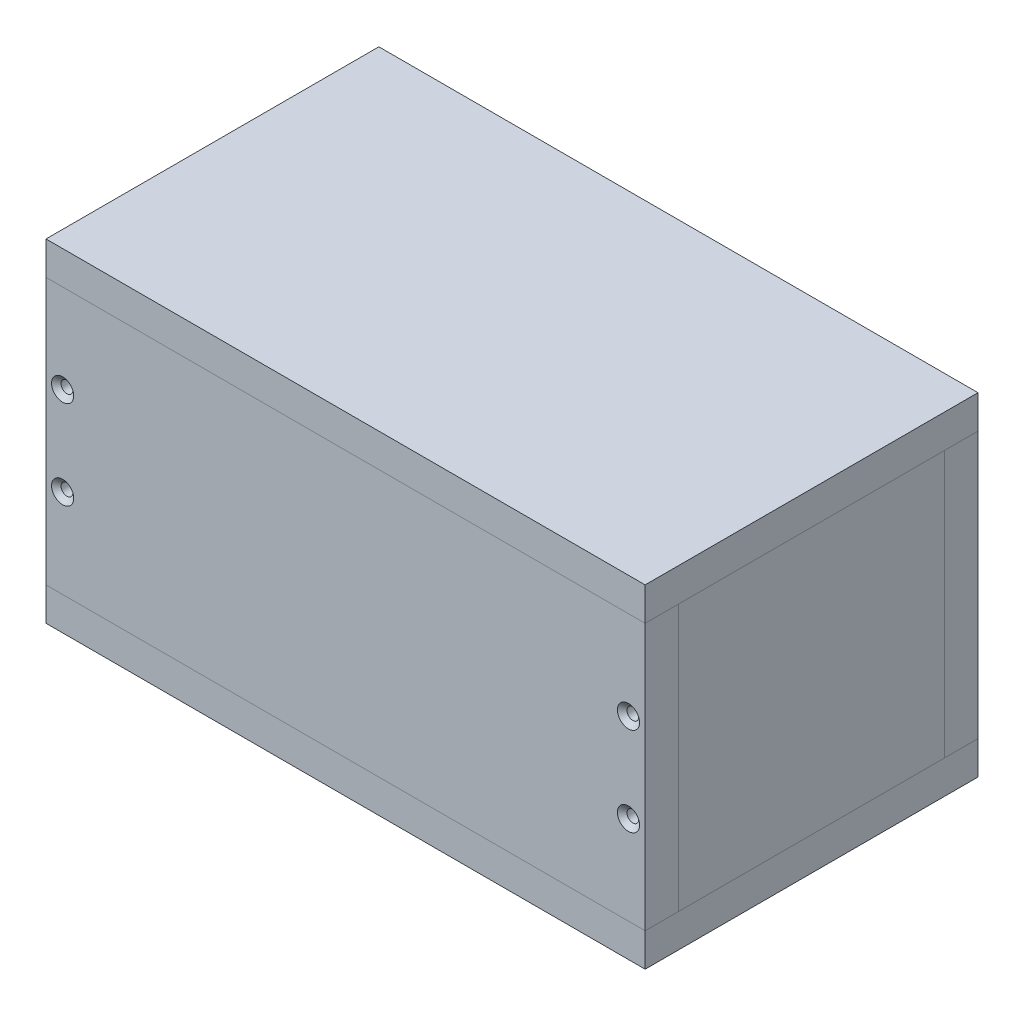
ISO-10303-21;
HEADER;
FILE_DESCRIPTION(('STEP AP214'),'2;1');
FILE_NAME('part.step','',(''),(''),'','','');
FILE_SCHEMA(('AUTOMOTIVE_DESIGN { 1 0 10303 214 1 1 1 1 }'));
ENDSEC;
DATA;
#1=APPLICATION_CONTEXT('core data for automotive mechanical design processes');
#2=APPLICATION_PROTOCOL_DEFINITION('international standard','automotive_design',2000,#1);
#3=PRODUCT_CONTEXT('',#1,'mechanical');
#4=PRODUCT('Part','Part','',(#3));
#5=PRODUCT_RELATED_PRODUCT_CATEGORY('part','',(#4));
#6=PRODUCT_DEFINITION_FORMATION('','',#4);
#7=PRODUCT_DEFINITION_CONTEXT('part definition',#1,'design');
#8=PRODUCT_DEFINITION('design','',#6,#7);
#9=PRODUCT_DEFINITION_SHAPE('','',#8);
#10=(LENGTH_UNIT() NAMED_UNIT(*) SI_UNIT(.MILLI.,.METRE.));
#11=(NAMED_UNIT(*) PLANE_ANGLE_UNIT() SI_UNIT($,.RADIAN.));
#12=(NAMED_UNIT(*) SI_UNIT($,.STERADIAN.) SOLID_ANGLE_UNIT());
#13=UNCERTAINTY_MEASURE_WITH_UNIT(LENGTH_MEASURE(1.E-05),#10,'distance_accuracy_value','');
#14=(GEOMETRIC_REPRESENTATION_CONTEXT(3) GLOBAL_UNCERTAINTY_ASSIGNED_CONTEXT((#13)) GLOBAL_UNIT_ASSIGNED_CONTEXT((#10,
#11,#12)) REPRESENTATION_CONTEXT('',''));
#15=CARTESIAN_POINT('',(0.,0.,0.));
#16=DIRECTION('',(0.,0.,1.));
#17=DIRECTION('',(1.,0.,0.));
#18=AXIS2_PLACEMENT_3D('',#15,#16,#17);
#19=CARTESIAN_POINT('',(3.17500000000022,12.7,3.17500000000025));
#20=DIRECTION('',(0.707106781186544,0.,0.707106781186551));
#21=DIRECTION('',(0.707106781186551,0.,-0.707106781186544));
#22=AXIS2_PLACEMENT_3D('',#19,#20,#21);
#23=PLANE('',#22);
#24=DIRECTION('',(-0.707106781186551,0.,0.707106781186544));
#25=VECTOR('',#24,1.);
#26=CARTESIAN_POINT('',(3.17500000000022,0.,3.17500000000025));
#27=LINE('',#26,#25);
#28=CARTESIAN_POINT('',(-19.0499999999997,0.,25.4));
#29=VERTEX_POINT('',#28);
#30=CARTESIAN_POINT('',(-44.45,0.,50.8));
#31=VERTEX_POINT('',#30);
#32=EDGE_CURVE('E108',#29,#31,#27,.T.);
#33=ORIENTED_EDGE('',*,*,#32,.T.);
#34=DIRECTION('',(0.,-1.,0.));
#35=VECTOR('',#34,1.);
#36=CARTESIAN_POINT('',(-44.45,12.7,50.8));
#37=LINE('',#36,#35);
#38=CARTESIAN_POINT('',(-44.45,12.7,50.8));
#39=VERTEX_POINT('',#38);
#40=EDGE_CURVE('E12',#39,#31,#37,.T.);
#41=ORIENTED_EDGE('',*,*,#40,.F.);
#42=DIRECTION('',(-0.707106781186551,0.,0.707106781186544));
#43=VECTOR('',#42,1.);
#44=CARTESIAN_POINT('',(3.17500000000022,12.7,3.17500000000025));
#45=LINE('',#44,#43);
#46=CARTESIAN_POINT('',(-19.0499999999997,12.7,25.4));
#47=VERTEX_POINT('',#46);
#48=EDGE_CURVE('E96',#47,#39,#45,.T.);
#49=ORIENTED_EDGE('',*,*,#48,.F.);
#50=DIRECTION('',(0.,-1.,0.));
#51=VECTOR('',#50,1.);
#52=CARTESIAN_POINT('',(-19.0499999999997,12.7,25.4));
#53=LINE('',#52,#51);
#54=EDGE_CURVE('E104',#47,#29,#53,.T.);
#55=ORIENTED_EDGE('',*,*,#54,.T.);
#56=EDGE_LOOP('',(#33,#41,#49,#55));
#57=FACE_BOUND('',#56,.T.);
#58=ADVANCED_FACE('F45',(#57),#23,.F.);
#59=CARTESIAN_POINT('',(0.,12.7,50.8));
#60=DIRECTION('',(0.,0.,-1.));
#61=DIRECTION('',(-1.,0.,0.));
#62=AXIS2_PLACEMENT_3D('',#59,#60,#61);
#63=PLANE('',#62);
#64=DIRECTION('',(1.,0.,0.));
#65=VECTOR('',#64,1.);
#66=CARTESIAN_POINT('',(0.,0.,50.8));
#67=LINE('',#66,#65);
#68=CARTESIAN_POINT('',(31.75,0.,50.8));
#69=VERTEX_POINT('',#68);
#70=EDGE_CURVE('E100',#31,#69,#67,.T.);
#71=ORIENTED_EDGE('',*,*,#70,.T.);
#72=DIRECTION('',(0.,-1.,0.));
#73=VECTOR('',#72,1.);
#74=CARTESIAN_POINT('',(31.75,12.7,50.8));
#75=LINE('',#74,#73);
#76=CARTESIAN_POINT('',(31.75,12.7,50.8));
#77=VERTEX_POINT('',#76);
#78=EDGE_CURVE('E53',#77,#69,#75,.T.);
#79=ORIENTED_EDGE('',*,*,#78,.F.);
#80=DIRECTION('',(1.,0.,0.));
#81=VECTOR('',#80,1.);
#82=CARTESIAN_POINT('',(0.,12.7,50.8));
#83=LINE('',#82,#81);
#84=EDGE_CURVE('E91',#39,#77,#83,.T.);
#85=ORIENTED_EDGE('',*,*,#84,.F.);
#86=ORIENTED_EDGE('',*,*,#40,.T.);
#87=EDGE_LOOP('',(#71,#79,#85,#86));
#88=FACE_BOUND('',#87,.T.);
#89=ADVANCED_FACE('F99',(#88),#63,.F.);
#90=CARTESIAN_POINT('',(31.75,12.7,0.));
#91=DIRECTION('',(-1.,0.,0.));
#92=DIRECTION('',(0.,0.,1.));
#93=AXIS2_PLACEMENT_3D('',#90,#91,#92);
#94=PLANE('',#93);
#95=DIRECTION('',(0.,0.,-1.));
#96=VECTOR('',#95,1.);
#97=CARTESIAN_POINT('',(31.75,0.,0.));
#98=LINE('',#97,#96);
#99=CARTESIAN_POINT('',(31.75,0.,25.4));
#100=VERTEX_POINT('',#99);
#101=EDGE_CURVE('E78',#69,#100,#98,.T.);
#102=ORIENTED_EDGE('',*,*,#101,.T.);
#103=DIRECTION('',(0.,-1.,0.));
#104=VECTOR('',#103,1.);
#105=CARTESIAN_POINT('',(31.75,12.7,25.4));
#106=LINE('',#105,#104);
#107=CARTESIAN_POINT('',(31.75,12.7,25.4));
#108=VERTEX_POINT('',#107);
#109=EDGE_CURVE('E101',#108,#100,#106,.T.);
#110=ORIENTED_EDGE('',*,*,#109,.F.);
#111=DIRECTION('',(0.,0.,-1.));
#112=VECTOR('',#111,1.);
#113=CARTESIAN_POINT('',(31.75,12.7,0.));
#114=LINE('',#113,#112);
#115=EDGE_CURVE('E94',#77,#108,#114,.T.);
#116=ORIENTED_EDGE('',*,*,#115,.F.);
#117=ORIENTED_EDGE('',*,*,#78,.T.);
#118=EDGE_LOOP('',(#102,#110,#116,#117));
#119=FACE_BOUND('',#118,.T.);
#120=ADVANCED_FACE('F102',(#119),#94,.F.);
#121=CARTESIAN_POINT('',(0.,12.7,25.4));
#122=DIRECTION('',(0.,0.,1.));
#123=DIRECTION('',(1.,0.,0.));
#124=AXIS2_PLACEMENT_3D('',#121,#122,#123);
#125=PLANE('',#124);
#126=DIRECTION('',(-1.,0.,0.));
#127=VECTOR('',#126,1.);
#128=CARTESIAN_POINT('',(0.,0.,25.4));
#129=LINE('',#128,#127);
#130=EDGE_CURVE('E84',#100,#29,#129,.T.);
#131=ORIENTED_EDGE('',*,*,#130,.T.);
#132=ORIENTED_EDGE('',*,*,#54,.F.);
#133=DIRECTION('',(-1.,0.,0.));
#134=VECTOR('',#133,1.);
#135=CARTESIAN_POINT('',(0.,12.7,25.4));
#136=LINE('',#135,#134);
#137=EDGE_CURVE('E61',#108,#47,#136,.T.);
#138=ORIENTED_EDGE('',*,*,#137,.F.);
#139=ORIENTED_EDGE('',*,*,#109,.T.);
#140=EDGE_LOOP('',(#131,#132,#138,#139));
#141=FACE_BOUND('',#140,.T.);
#142=ADVANCED_FACE('F115',(#141),#125,.F.);
#143=CARTESIAN_POINT('',(0.,12.7,0.));
#144=DIRECTION('',(0.,1.,0.));
#145=DIRECTION('',(0.,0.,1.));
#146=AXIS2_PLACEMENT_3D('',#143,#144,#145);
#147=PLANE('',#146);
#148=ORIENTED_EDGE('',*,*,#48,.T.);
#149=ORIENTED_EDGE('',*,*,#84,.T.);
#150=ORIENTED_EDGE('',*,*,#115,.T.);
#151=ORIENTED_EDGE('',*,*,#137,.T.);
#152=EDGE_LOOP('',(#148,#149,#150,#151));
#153=FACE_BOUND('',#152,.T.);
#154=ADVANCED_FACE('F92',(#153),#147,.T.);
#155=CARTESIAN_POINT('',(0.,0.,0.));
#156=DIRECTION('',(0.,1.,0.));
#157=DIRECTION('',(0.,0.,1.));
#158=AXIS2_PLACEMENT_3D('',#155,#156,#157);
#159=PLANE('',#158);
#160=ORIENTED_EDGE('',*,*,#32,.F.);
#161=ORIENTED_EDGE('',*,*,#130,.F.);
#162=ORIENTED_EDGE('',*,*,#101,.F.);
#163=ORIENTED_EDGE('',*,*,#70,.F.);
#164=EDGE_LOOP('',(#160,#161,#162,#163));
#165=FACE_BOUND('',#164,.T.);
#166=ADVANCED_FACE('F118',(#165),#159,.F.);
#167=CLOSED_SHELL('',(#58,#89,#120,#142,#154,#166));
#168=MANIFOLD_SOLID_BREP('B2',#167);
#169=CARTESIAN_POINT('',(0.,0.,0.));
#170=DIRECTION('',(0.,-1.,0.));
#171=DIRECTION('',(0.,0.,-1.));
#172=AXIS2_PLACEMENT_3D('',#169,#170,#171);
#173=PLANE('',#172);
#174=DIRECTION('',(0.707106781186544,0.,-0.707106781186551));
#175=VECTOR('',#174,1.);
#176=CARTESIAN_POINT('',(-101.6,0.,25.4));
#177=LINE('',#176,#175);
#178=CARTESIAN_POINT('',(-101.6,-1.13686837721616E-10,25.4));
#179=VERTEX_POINT('',#178);
#180=CARTESIAN_POINT('',(-25.4000000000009,-1.13686837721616E-10,-50.8));
#181=VERTEX_POINT('',#180);
#182=EDGE_CURVE('E218',#179,#181,#177,.T.);
#183=ORIENTED_EDGE('',*,*,#182,.F.);
#184=DIRECTION('',(0.,0.,1.));
#185=VECTOR('',#184,1.);
#186=CARTESIAN_POINT('',(-101.6,0.,7.43948775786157));
#187=LINE('',#186,#185);
#188=CARTESIAN_POINT('',(-101.6,-1.13686837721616E-10,7.43948775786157));
#189=VERTEX_POINT('',#188);
#190=EDGE_CURVE('E245',#189,#179,#187,.T.);
#191=ORIENTED_EDGE('',*,*,#190,.F.);
#192=DIRECTION('',(-0.707106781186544,0.,0.707106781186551));
#193=VECTOR('',#192,1.);
#194=CARTESIAN_POINT('',(-43.3605122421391,0.,-50.8));
#195=LINE('',#194,#193);
#196=CARTESIAN_POINT('',(-43.3605122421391,-1.13686837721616E-10,-50.8));
#197=VERTEX_POINT('',#196);
#198=EDGE_CURVE('E185',#197,#189,#195,.T.);
#199=ORIENTED_EDGE('',*,*,#198,.F.);
#200=DIRECTION('',(-1.,0.,0.));
#201=VECTOR('',#200,1.);
#202=CARTESIAN_POINT('',(-25.4000000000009,0.,-50.8));
#203=LINE('',#202,#201);
#204=EDGE_CURVE('E43',#181,#197,#203,.T.);
#205=ORIENTED_EDGE('',*,*,#204,.F.);
#206=EDGE_LOOP('',(#183,#191,#199,#205));
#207=FACE_BOUND('',#206,.T.);
#208=ADVANCED_FACE('F178',(#207),#173,.T.);
#209=CARTESIAN_POINT('',(-43.3605122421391,-500000.,-50.8));
#210=DIRECTION('',(-0.707106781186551,0.,-0.707106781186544));
#211=DIRECTION('',(-0.707106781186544,0.,0.707106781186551));
#212=AXIS2_PLACEMENT_3D('',#209,#210,#211);
#213=PLANE('',#212);
#214=DIRECTION('',(0.,1.,0.));
#215=VECTOR('',#214,1.);
#216=CARTESIAN_POINT('',(-43.3605122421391,-500000.,-50.8));
#217=LINE('',#216,#215);
#218=CARTESIAN_POINT('',(-43.3605122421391,101.6,-50.8));
#219=VERTEX_POINT('',#218);
#220=EDGE_CURVE('E213',#197,#219,#217,.T.);
#221=ORIENTED_EDGE('',*,*,#220,.F.);
#222=ORIENTED_EDGE('',*,*,#198,.T.);
#223=DIRECTION('',(0.,1.,0.));
#224=VECTOR('',#223,1.);
#225=CARTESIAN_POINT('',(-101.6,-500000.,7.43948775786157));
#226=LINE('',#225,#224);
#227=CARTESIAN_POINT('',(-101.6,101.6,7.43948775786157));
#228=VERTEX_POINT('',#227);
#229=EDGE_CURVE('E219',#189,#228,#226,.T.);
#230=ORIENTED_EDGE('',*,*,#229,.T.);
#231=DIRECTION('',(-0.707106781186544,0.,0.707106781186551));
#232=VECTOR('',#231,1.);
#233=CARTESIAN_POINT('',(-43.3605122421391,101.6,-50.8));
#234=LINE('',#233,#232);
#235=EDGE_CURVE('E222',#219,#228,#234,.T.);
#236=ORIENTED_EDGE('',*,*,#235,.F.);
#237=EDGE_LOOP('',(#221,#222,#230,#236));
#238=FACE_BOUND('',#237,.T.);
#239=ADVANCED_FACE('F223',(#238),#213,.T.);
#240=CARTESIAN_POINT('',(0.,101.6,0.));
#241=DIRECTION('',(0.,1.,0.));
#242=DIRECTION('',(0.,0.,1.));
#243=AXIS2_PLACEMENT_3D('',#240,#241,#242);
#244=PLANE('',#243);
#245=DIRECTION('',(-1.,0.,0.));
#246=VECTOR('',#245,1.);
#247=CARTESIAN_POINT('',(-25.4000000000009,101.6,-50.8));
#248=LINE('',#247,#246);
#249=CARTESIAN_POINT('',(-25.4000000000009,101.6,-50.8));
#250=VERTEX_POINT('',#249);
#251=EDGE_CURVE('E217',#250,#219,#248,.T.);
#252=ORIENTED_EDGE('',*,*,#251,.T.);
#253=ORIENTED_EDGE('',*,*,#235,.T.);
#254=DIRECTION('',(0.,0.,1.));
#255=VECTOR('',#254,1.);
#256=CARTESIAN_POINT('',(-101.6,101.6,7.43948775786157));
#257=LINE('',#256,#255);
#258=CARTESIAN_POINT('',(-101.6,101.6,25.4));
#259=VERTEX_POINT('',#258);
#260=EDGE_CURVE('E228',#228,#259,#257,.T.);
#261=ORIENTED_EDGE('',*,*,#260,.T.);
#262=DIRECTION('',(0.707106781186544,0.,-0.707106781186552));
#263=VECTOR('',#262,1.);
#264=CARTESIAN_POINT('',(-101.6,101.6,25.4));
#265=LINE('',#264,#263);
#266=EDGE_CURVE('E233',#259,#250,#265,.T.);
#267=ORIENTED_EDGE('',*,*,#266,.T.);
#268=EDGE_LOOP('',(#252,#253,#261,#267));
#269=FACE_BOUND('',#268,.T.);
#270=ADVANCED_FACE('F231',(#269),#244,.T.);
#271=CARTESIAN_POINT('',(-25.4000000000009,-500000.,-50.8));
#272=DIRECTION('',(0.,0.,-1.));
#273=DIRECTION('',(-1.,0.,0.));
#274=AXIS2_PLACEMENT_3D('',#271,#272,#273);
#275=PLANE('',#274);
#276=DIRECTION('',(0.,1.,0.));
#277=VECTOR('',#276,1.);
#278=CARTESIAN_POINT('',(-25.4000000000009,-500000.,-50.8));
#279=LINE('',#278,#277);
#280=EDGE_CURVE('E238',#181,#250,#279,.T.);
#281=ORIENTED_EDGE('',*,*,#280,.F.);
#282=ORIENTED_EDGE('',*,*,#204,.T.);
#283=ORIENTED_EDGE('',*,*,#220,.T.);
#284=ORIENTED_EDGE('',*,*,#251,.F.);
#285=EDGE_LOOP('',(#281,#282,#283,#284));
#286=FACE_BOUND('',#285,.T.);
#287=ADVANCED_FACE('F215',(#286),#275,.T.);
#288=CARTESIAN_POINT('',(-101.6,-500000.,7.43948775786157));
#289=DIRECTION('',(-1.,0.,0.));
#290=DIRECTION('',(0.,0.,1.));
#291=AXIS2_PLACEMENT_3D('',#288,#289,#290);
#292=PLANE('',#291);
#293=ORIENTED_EDGE('',*,*,#229,.F.);
#294=ORIENTED_EDGE('',*,*,#190,.T.);
#295=DIRECTION('',(0.,1.,0.));
#296=VECTOR('',#295,1.);
#297=CARTESIAN_POINT('',(-101.6,-500000.,25.4));
#298=LINE('',#297,#296);
#299=EDGE_CURVE('E240',#179,#259,#298,.T.);
#300=ORIENTED_EDGE('',*,*,#299,.T.);
#301=ORIENTED_EDGE('',*,*,#260,.F.);
#302=EDGE_LOOP('',(#293,#294,#300,#301));
#303=FACE_BOUND('',#302,.T.);
#304=ADVANCED_FACE('F248',(#303),#292,.T.);
#305=CARTESIAN_POINT('',(-101.6,-500000.,25.4));
#306=DIRECTION('',(0.707106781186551,0.,0.707106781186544));
#307=DIRECTION('',(0.707106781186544,0.,-0.707106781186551));
#308=AXIS2_PLACEMENT_3D('',#305,#306,#307);
#309=PLANE('',#308);
#310=ORIENTED_EDGE('',*,*,#299,.F.);
#311=ORIENTED_EDGE('',*,*,#182,.T.);
#312=ORIENTED_EDGE('',*,*,#280,.T.);
#313=ORIENTED_EDGE('',*,*,#266,.F.);
#314=EDGE_LOOP('',(#310,#311,#312,#313));
#315=FACE_BOUND('',#314,.T.);
#316=ADVANCED_FACE('F252',(#315),#309,.T.);
#317=CLOSED_SHELL('',(#208,#239,#270,#287,#304,#316));
#318=MANIFOLD_SOLID_BREP('B6',#317);
#319=CARTESIAN_POINT('',(0.,0.,0.));
#320=DIRECTION('',(0.,-1.,0.));
#321=DIRECTION('',(0.,0.,-1.));
#322=AXIS2_PLACEMENT_3D('',#319,#320,#321);
#323=PLANE('',#322);
#324=DIRECTION('',(1.,0.,0.));
#325=VECTOR('',#324,1.);
#326=CARTESIAN_POINT('',(76.2000000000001,0.,50.8));
#327=LINE('',#326,#325);
#328=CARTESIAN_POINT('',(63.5000000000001,-1.13686837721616E-10,50.8));
#329=VERTEX_POINT('',#328);
#330=CARTESIAN_POINT('',(76.2000000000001,-1.13686837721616E-10,50.8));
#331=VERTEX_POINT('',#330);
#332=EDGE_CURVE('E351',#329,#331,#327,.T.);
#333=ORIENTED_EDGE('',*,*,#332,.F.);
#334=DIRECTION('',(0.,0.,1.));
#335=VECTOR('',#334,1.);
#336=CARTESIAN_POINT('',(63.5,0.,-50.8));
#337=LINE('',#336,#335);
#338=CARTESIAN_POINT('',(63.5,-1.13686837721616E-10,-50.8));
#339=VERTEX_POINT('',#338);
#340=EDGE_CURVE('E378',#339,#329,#337,.T.);
#341=ORIENTED_EDGE('',*,*,#340,.F.);
#342=DIRECTION('',(-1.,0.,0.));
#343=VECTOR('',#342,1.);
#344=CARTESIAN_POINT('',(76.2,0.,-50.8));
#345=LINE('',#344,#343);
#346=CARTESIAN_POINT('',(76.2,-1.13686837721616E-10,-50.8));
#347=VERTEX_POINT('',#346);
#348=EDGE_CURVE('E318',#347,#339,#345,.T.);
#349=ORIENTED_EDGE('',*,*,#348,.F.);
#350=DIRECTION('',(0.,0.,-1.));
#351=VECTOR('',#350,1.);
#352=CARTESIAN_POINT('',(76.2,0.,-50.8));
#353=LINE('',#352,#351);
#354=EDGE_CURVE('E176',#331,#347,#353,.T.);
#355=ORIENTED_EDGE('',*,*,#354,.F.);
#356=EDGE_LOOP('',(#333,#341,#349,#355));
#357=FACE_BOUND('',#356,.T.);
#358=ADVANCED_FACE('F311',(#357),#323,.T.);
#359=CARTESIAN_POINT('',(76.2,-500000.,-50.8));
#360=DIRECTION('',(0.,0.,-1.));
#361=DIRECTION('',(-1.,0.,0.));
#362=AXIS2_PLACEMENT_3D('',#359,#360,#361);
#363=PLANE('',#362);
#364=DIRECTION('',(0.,1.,0.));
#365=VECTOR('',#364,1.);
#366=CARTESIAN_POINT('',(76.2,-500000.,-50.8));
#367=LINE('',#366,#365);
#368=CARTESIAN_POINT('',(76.2,101.6,-50.8));
#369=VERTEX_POINT('',#368);
#370=EDGE_CURVE('E346',#347,#369,#367,.T.);
#371=ORIENTED_EDGE('',*,*,#370,.F.);
#372=ORIENTED_EDGE('',*,*,#348,.T.);
#373=DIRECTION('',(0.,1.,0.));
#374=VECTOR('',#373,1.);
#375=CARTESIAN_POINT('',(63.5,-500000.,-50.8));
#376=LINE('',#375,#374);
#377=CARTESIAN_POINT('',(63.5,101.6,-50.8));
#378=VERTEX_POINT('',#377);
#379=EDGE_CURVE('E352',#339,#378,#376,.T.);
#380=ORIENTED_EDGE('',*,*,#379,.T.);
#381=DIRECTION('',(-1.,0.,0.));
#382=VECTOR('',#381,1.);
#383=CARTESIAN_POINT('',(76.2,101.6,-50.8));
#384=LINE('',#383,#382);
#385=EDGE_CURVE('E355',#369,#378,#384,.T.);
#386=ORIENTED_EDGE('',*,*,#385,.F.);
#387=EDGE_LOOP('',(#371,#372,#380,#386));
#388=FACE_BOUND('',#387,.T.);
#389=ADVANCED_FACE('F356',(#388),#363,.T.);
#390=CARTESIAN_POINT('',(0.,101.6,0.));
#391=DIRECTION('',(0.,-1.,0.));
#392=DIRECTION('',(0.,0.,-1.));
#393=AXIS2_PLACEMENT_3D('',#390,#391,#392);
#394=PLANE('',#393);
#395=DIRECTION('',(0.,0.,-1.));
#396=VECTOR('',#395,1.);
#397=CARTESIAN_POINT('',(76.2,101.6,-50.8));
#398=LINE('',#397,#396);
#399=CARTESIAN_POINT('',(76.2000000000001,101.6,50.8));
#400=VERTEX_POINT('',#399);
#401=EDGE_CURVE('E350',#400,#369,#398,.T.);
#402=ORIENTED_EDGE('',*,*,#401,.T.);
#403=ORIENTED_EDGE('',*,*,#385,.T.);
#404=DIRECTION('',(0.,0.,1.));
#405=VECTOR('',#404,1.);
#406=CARTESIAN_POINT('',(63.5,101.6,-50.8));
#407=LINE('',#406,#405);
#408=CARTESIAN_POINT('',(63.5000000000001,101.6,50.8));
#409=VERTEX_POINT('',#408);
#410=EDGE_CURVE('E362',#378,#409,#407,.T.);
#411=ORIENTED_EDGE('',*,*,#410,.T.);
#412=DIRECTION('',(1.,0.,0.));
#413=VECTOR('',#412,1.);
#414=CARTESIAN_POINT('',(76.2000000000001,101.6,50.8));
#415=LINE('',#414,#413);
#416=EDGE_CURVE('E367',#409,#400,#415,.T.);
#417=ORIENTED_EDGE('',*,*,#416,.T.);
#418=EDGE_LOOP('',(#402,#403,#411,#417));
#419=FACE_BOUND('',#418,.T.);
#420=ADVANCED_FACE('F365',(#419),#394,.F.);
#421=CARTESIAN_POINT('',(76.2,-500000.,-50.8));
#422=DIRECTION('',(1.,0.,0.));
#423=DIRECTION('',(0.,0.,-1.));
#424=AXIS2_PLACEMENT_3D('',#421,#422,#423);
#425=PLANE('',#424);
#426=DIRECTION('',(0.,1.,0.));
#427=VECTOR('',#426,1.);
#428=CARTESIAN_POINT('',(76.2000000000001,-500000.,50.8));
#429=LINE('',#428,#427);
#430=EDGE_CURVE('E361',#331,#400,#429,.T.);
#431=ORIENTED_EDGE('',*,*,#430,.F.);
#432=ORIENTED_EDGE('',*,*,#354,.T.);
#433=ORIENTED_EDGE('',*,*,#370,.T.);
#434=ORIENTED_EDGE('',*,*,#401,.F.);
#435=EDGE_LOOP('',(#431,#432,#433,#434));
#436=FACE_BOUND('',#435,.T.);
#437=ADVANCED_FACE('F348',(#436),#425,.T.);
#438=CARTESIAN_POINT('',(63.5,-500000.,-50.8));
#439=DIRECTION('',(-1.,0.,0.));
#440=DIRECTION('',(0.,0.,1.));
#441=AXIS2_PLACEMENT_3D('',#438,#439,#440);
#442=PLANE('',#441);
#443=ORIENTED_EDGE('',*,*,#379,.F.);
#444=ORIENTED_EDGE('',*,*,#340,.T.);
#445=DIRECTION('',(0.,1.,0.));
#446=VECTOR('',#445,1.);
#447=CARTESIAN_POINT('',(63.5000000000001,-500000.,50.8));
#448=LINE('',#447,#446);
#449=EDGE_CURVE('E373',#329,#409,#448,.T.);
#450=ORIENTED_EDGE('',*,*,#449,.T.);
#451=ORIENTED_EDGE('',*,*,#410,.F.);
#452=EDGE_LOOP('',(#443,#444,#450,#451));
#453=FACE_BOUND('',#452,.T.);
#454=ADVANCED_FACE('F381',(#453),#442,.T.);
#455=CARTESIAN_POINT('',(76.2000000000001,-500000.,50.8));
#456=DIRECTION('',(0.,0.,1.));
#457=DIRECTION('',(1.,0.,0.));
#458=AXIS2_PLACEMENT_3D('',#455,#456,#457);
#459=PLANE('',#458);
#460=ORIENTED_EDGE('',*,*,#449,.F.);
#461=ORIENTED_EDGE('',*,*,#332,.T.);
#462=ORIENTED_EDGE('',*,*,#430,.T.);
#463=ORIENTED_EDGE('',*,*,#416,.F.);
#464=EDGE_LOOP('',(#460,#461,#462,#463));
#465=FACE_BOUND('',#464,.T.);
#466=ADVANCED_FACE('F385',(#465),#459,.T.);
#467=CLOSED_SHELL('',(#358,#389,#420,#437,#454,#466));
#468=MANIFOLD_SOLID_BREP('B37',#467);
#469=CARTESIAN_POINT('',(114.3,114.3,63.5));
#470=DIRECTION('',(-1.,0.,0.));
#471=DIRECTION('',(0.,0.,1.));
#472=AXIS2_PLACEMENT_3D('',#469,#470,#471);
#473=PLANE('',#472);
#474=DIRECTION('',(0.,0.,-1.));
#475=VECTOR('',#474,1.);
#476=CARTESIAN_POINT('',(114.3,101.6,63.5));
#477=LINE('',#476,#475);
#478=CARTESIAN_POINT('',(114.3,101.6,63.5));
#479=VERTEX_POINT('',#478);
#480=CARTESIAN_POINT('',(114.3,101.6,-63.5));
#481=VERTEX_POINT('',#480);
#482=EDGE_CURVE('E507',#479,#481,#477,.T.);
#483=ORIENTED_EDGE('',*,*,#482,.T.);
#484=DIRECTION('',(0.,-1.,0.));
#485=VECTOR('',#484,1.);
#486=CARTESIAN_POINT('',(114.3,114.3,-63.5));
#487=LINE('',#486,#485);
#488=CARTESIAN_POINT('',(114.3,114.3,-63.5));
#489=VERTEX_POINT('',#488);
#490=EDGE_CURVE('E309',#489,#481,#487,.T.);
#491=ORIENTED_EDGE('',*,*,#490,.F.);
#492=DIRECTION('',(0.,0.,-1.));
#493=VECTOR('',#492,1.);
#494=CARTESIAN_POINT('',(114.3,114.3,63.5));
#495=LINE('',#494,#493);
#496=CARTESIAN_POINT('',(114.3,114.3,63.5));
#497=VERTEX_POINT('',#496);
#498=EDGE_CURVE('E495',#497,#489,#495,.T.);
#499=ORIENTED_EDGE('',*,*,#498,.F.);
#500=DIRECTION('',(0.,-1.,0.));
#501=VECTOR('',#500,1.);
#502=CARTESIAN_POINT('',(114.3,114.3,63.5));
#503=LINE('',#502,#501);
#504=EDGE_CURVE('E503',#497,#479,#503,.T.);
#505=ORIENTED_EDGE('',*,*,#504,.T.);
#506=EDGE_LOOP('',(#483,#491,#499,#505));
#507=FACE_BOUND('',#506,.T.);
#508=ADVANCED_FACE('F444',(#507),#473,.F.);
#509=CARTESIAN_POINT('',(114.3,114.3,-63.5));
#510=DIRECTION('',(0.,0.,1.));
#511=DIRECTION('',(1.,0.,0.));
#512=AXIS2_PLACEMENT_3D('',#509,#510,#511);
#513=PLANE('',#512);
#514=DIRECTION('',(-1.,0.,0.));
#515=VECTOR('',#514,1.);
#516=CARTESIAN_POINT('',(114.3,101.6,-63.5));
#517=LINE('',#516,#515);
#518=CARTESIAN_POINT('',(-114.3,101.6,-63.5));
#519=VERTEX_POINT('',#518);
#520=EDGE_CURVE('E499',#481,#519,#517,.T.);
#521=ORIENTED_EDGE('',*,*,#520,.T.);
#522=DIRECTION('',(0.,-1.,0.));
#523=VECTOR('',#522,1.);
#524=CARTESIAN_POINT('',(-114.3,114.3,-63.5));
#525=LINE('',#524,#523);
#526=CARTESIAN_POINT('',(-114.3,114.3,-63.5));
#527=VERTEX_POINT('',#526);
#528=EDGE_CURVE('E452',#527,#519,#525,.T.);
#529=ORIENTED_EDGE('',*,*,#528,.F.);
#530=DIRECTION('',(-1.,0.,0.));
#531=VECTOR('',#530,1.);
#532=CARTESIAN_POINT('',(114.3,114.3,-63.5));
#533=LINE('',#532,#531);
#534=EDGE_CURVE('E490',#489,#527,#533,.T.);
#535=ORIENTED_EDGE('',*,*,#534,.F.);
#536=ORIENTED_EDGE('',*,*,#490,.T.);
#537=EDGE_LOOP('',(#521,#529,#535,#536));
#538=FACE_BOUND('',#537,.T.);
#539=ADVANCED_FACE('F498',(#538),#513,.F.);
#540=CARTESIAN_POINT('',(-114.3,114.3,63.5));
#541=DIRECTION('',(1.,0.,0.));
#542=DIRECTION('',(0.,0.,-1.));
#543=AXIS2_PLACEMENT_3D('',#540,#541,#542);
#544=PLANE('',#543);
#545=DIRECTION('',(0.,0.,1.));
#546=VECTOR('',#545,1.);
#547=CARTESIAN_POINT('',(-114.3,101.6,63.5));
#548=LINE('',#547,#546);
#549=CARTESIAN_POINT('',(-114.3,101.6,63.5));
#550=VERTEX_POINT('',#549);
#551=EDGE_CURVE('E477',#519,#550,#548,.T.);
#552=ORIENTED_EDGE('',*,*,#551,.T.);
#553=DIRECTION('',(0.,-1.,0.));
#554=VECTOR('',#553,1.);
#555=CARTESIAN_POINT('',(-114.3,114.3,63.5));
#556=LINE('',#555,#554);
#557=CARTESIAN_POINT('',(-114.3,114.3,63.5));
#558=VERTEX_POINT('',#557);
#559=EDGE_CURVE('E500',#558,#550,#556,.T.);
#560=ORIENTED_EDGE('',*,*,#559,.F.);
#561=DIRECTION('',(0.,0.,1.));
#562=VECTOR('',#561,1.);
#563=CARTESIAN_POINT('',(-114.3,114.3,63.5));
#564=LINE('',#563,#562);
#565=EDGE_CURVE('E493',#527,#558,#564,.T.);
#566=ORIENTED_EDGE('',*,*,#565,.F.);
#567=ORIENTED_EDGE('',*,*,#528,.T.);
#568=EDGE_LOOP('',(#552,#560,#566,#567));
#569=FACE_BOUND('',#568,.T.);
#570=ADVANCED_FACE('F501',(#569),#544,.F.);
#571=CARTESIAN_POINT('',(114.3,114.3,63.5));
#572=DIRECTION('',(0.,0.,-1.));
#573=DIRECTION('',(-1.,0.,0.));
#574=AXIS2_PLACEMENT_3D('',#571,#572,#573);
#575=PLANE('',#574);
#576=DIRECTION('',(1.,0.,0.));
#577=VECTOR('',#576,1.);
#578=CARTESIAN_POINT('',(114.3,101.6,63.5));
#579=LINE('',#578,#577);
#580=EDGE_CURVE('E483',#550,#479,#579,.T.);
#581=ORIENTED_EDGE('',*,*,#580,.T.);
#582=ORIENTED_EDGE('',*,*,#504,.F.);
#583=DIRECTION('',(1.,0.,0.));
#584=VECTOR('',#583,1.);
#585=CARTESIAN_POINT('',(114.3,114.3,63.5));
#586=LINE('',#585,#584);
#587=EDGE_CURVE('E460',#558,#497,#586,.T.);
#588=ORIENTED_EDGE('',*,*,#587,.F.);
#589=ORIENTED_EDGE('',*,*,#559,.T.);
#590=EDGE_LOOP('',(#581,#582,#588,#589));
#591=FACE_BOUND('',#590,.T.);
#592=ADVANCED_FACE('F514',(#591),#575,.F.);
#593=CARTESIAN_POINT('',(0.,114.3,0.));
#594=DIRECTION('',(0.,1.,0.));
#595=DIRECTION('',(0.,0.,1.));
#596=AXIS2_PLACEMENT_3D('',#593,#594,#595);
#597=PLANE('',#596);
#598=ORIENTED_EDGE('',*,*,#498,.T.);
#599=ORIENTED_EDGE('',*,*,#534,.T.);
#600=ORIENTED_EDGE('',*,*,#565,.T.);
#601=ORIENTED_EDGE('',*,*,#587,.T.);
#602=EDGE_LOOP('',(#598,#599,#600,#601));
#603=FACE_BOUND('',#602,.T.);
#604=ADVANCED_FACE('F491',(#603),#597,.T.);
#605=CARTESIAN_POINT('',(0.,101.6,0.));
#606=DIRECTION('',(0.,1.,0.));
#607=DIRECTION('',(0.,0.,1.));
#608=AXIS2_PLACEMENT_3D('',#605,#606,#607);
#609=PLANE('',#608);
#610=ORIENTED_EDGE('',*,*,#482,.F.);
#611=ORIENTED_EDGE('',*,*,#580,.F.);
#612=ORIENTED_EDGE('',*,*,#551,.F.);
#613=ORIENTED_EDGE('',*,*,#520,.F.);
#614=EDGE_LOOP('',(#610,#611,#612,#613));
#615=FACE_BOUND('',#614,.T.);
#616=ADVANCED_FACE('F517',(#615),#609,.F.);
#617=CLOSED_SHELL('',(#508,#539,#570,#592,#604,#616));
#618=MANIFOLD_SOLID_BREP('B170_NOT_SHOWN',#617);
#619=CARTESIAN_POINT('',(114.3,-12.7,-63.5));
#620=DIRECTION('',(1.,0.,0.));
#621=DIRECTION('',(0.,0.,-1.));
#622=AXIS2_PLACEMENT_3D('',#619,#620,#621);
#623=PLANE('',#622);
#624=DIRECTION('',(0.,0.,-1.));
#625=VECTOR('',#624,1.);
#626=CARTESIAN_POINT('',(114.3,0.,-63.5));
#627=LINE('',#626,#625);
#628=CARTESIAN_POINT('',(114.3,0.,63.4999999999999));
#629=VERTEX_POINT('',#628);
#630=CARTESIAN_POINT('',(114.3,0.,-63.5));
#631=VERTEX_POINT('',#630);
#632=EDGE_CURVE('E644',#629,#631,#627,.T.);
#633=ORIENTED_EDGE('',*,*,#632,.F.);
#634=DIRECTION('',(0.,1.,0.));
#635=VECTOR('',#634,1.);
#636=CARTESIAN_POINT('',(114.3,-12.7,63.4999999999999));
#637=LINE('',#636,#635);
#638=CARTESIAN_POINT('',(114.3,-12.7,63.4999999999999));
#639=VERTEX_POINT('',#638);
#640=EDGE_CURVE('E442',#639,#629,#637,.T.);
#641=ORIENTED_EDGE('',*,*,#640,.F.);
#642=DIRECTION('',(0.,0.,-1.));
#643=VECTOR('',#642,1.);
#644=CARTESIAN_POINT('',(114.3,-12.7,-63.5));
#645=LINE('',#644,#643);
#646=CARTESIAN_POINT('',(114.3,-12.7,-63.5));
#647=VERTEX_POINT('',#646);
#648=EDGE_CURVE('E637',#639,#647,#645,.T.);
#649=ORIENTED_EDGE('',*,*,#648,.T.);
#650=DIRECTION('',(0.,1.,0.));
#651=VECTOR('',#650,1.);
#652=CARTESIAN_POINT('',(114.3,-12.7,-63.5));
#653=LINE('',#652,#651);
#654=EDGE_CURVE('E620',#647,#631,#653,.T.);
#655=ORIENTED_EDGE('',*,*,#654,.T.);
#656=EDGE_LOOP('',(#633,#641,#649,#655));
#657=FACE_BOUND('',#656,.T.);
#658=ADVANCED_FACE('F577',(#657),#623,.T.);
#659=CARTESIAN_POINT('',(114.3,-12.7,63.4999999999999));
#660=DIRECTION('',(0.,0.,1.));
#661=DIRECTION('',(1.,0.,0.));
#662=AXIS2_PLACEMENT_3D('',#659,#660,#661);
#663=PLANE('',#662);
#664=DIRECTION('',(1.,0.,0.));
#665=VECTOR('',#664,1.);
#666=CARTESIAN_POINT('',(114.3,0.,63.4999999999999));
#667=LINE('',#666,#665);
#668=CARTESIAN_POINT('',(-114.3,0.,63.5));
#669=VERTEX_POINT('',#668);
#670=EDGE_CURVE('E639',#669,#629,#667,.T.);
#671=ORIENTED_EDGE('',*,*,#670,.F.);
#672=DIRECTION('',(0.,1.,0.));
#673=VECTOR('',#672,1.);
#674=CARTESIAN_POINT('',(-114.3,-12.7,63.5));
#675=LINE('',#674,#673);
#676=CARTESIAN_POINT('',(-114.3,-12.7,63.5));
#677=VERTEX_POINT('',#676);
#678=EDGE_CURVE('E586',#677,#669,#675,.T.);
#679=ORIENTED_EDGE('',*,*,#678,.F.);
#680=DIRECTION('',(1.,0.,0.));
#681=VECTOR('',#680,1.);
#682=CARTESIAN_POINT('',(114.3,-12.7,63.4999999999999));
#683=LINE('',#682,#681);
#684=EDGE_CURVE('E634',#677,#639,#683,.T.);
#685=ORIENTED_EDGE('',*,*,#684,.T.);
#686=ORIENTED_EDGE('',*,*,#640,.T.);
#687=EDGE_LOOP('',(#671,#679,#685,#686));
#688=FACE_BOUND('',#687,.T.);
#689=ADVANCED_FACE('F709',(#688),#663,.T.);
#690=CARTESIAN_POINT('',(-114.3,-12.7,-63.5));
#691=DIRECTION('',(-1.,0.,0.));
#692=DIRECTION('',(0.,0.,1.));
#693=AXIS2_PLACEMENT_3D('',#690,#691,#692);
#694=PLANE('',#693);
#695=DIRECTION('',(0.,0.,1.));
#696=VECTOR('',#695,1.);
#697=CARTESIAN_POINT('',(-114.3,0.,-63.5));
#698=LINE('',#697,#696);
#699=CARTESIAN_POINT('',(-114.3,0.,-63.5));
#700=VERTEX_POINT('',#699);
#701=EDGE_CURVE('E628',#700,#669,#698,.T.);
#702=ORIENTED_EDGE('',*,*,#701,.F.);
#703=DIRECTION('',(0.,1.,0.));
#704=VECTOR('',#703,1.);
#705=CARTESIAN_POINT('',(-114.3,-12.7,-63.5));
#706=LINE('',#705,#704);
#707=CARTESIAN_POINT('',(-114.3,-12.7,-63.5));
#708=VERTEX_POINT('',#707);
#709=EDGE_CURVE('E623',#708,#700,#706,.T.);
#710=ORIENTED_EDGE('',*,*,#709,.F.);
#711=DIRECTION('',(0.,0.,1.));
#712=VECTOR('',#711,1.);
#713=CARTESIAN_POINT('',(-114.3,-12.7,-63.5));
#714=LINE('',#713,#712);
#715=EDGE_CURVE('E626',#708,#677,#714,.T.);
#716=ORIENTED_EDGE('',*,*,#715,.T.);
#717=ORIENTED_EDGE('',*,*,#678,.T.);
#718=EDGE_LOOP('',(#702,#710,#716,#717));
#719=FACE_BOUND('',#718,.T.);
#720=ADVANCED_FACE('F625',(#719),#694,.T.);
#721=CARTESIAN_POINT('',(114.3,-12.7,-63.5));
#722=DIRECTION('',(0.,0.,-1.));
#723=DIRECTION('',(-1.,0.,0.));
#724=AXIS2_PLACEMENT_3D('',#721,#722,#723);
#725=PLANE('',#724);
#726=DIRECTION('',(-1.,0.,0.));
#727=VECTOR('',#726,1.);
#728=CARTESIAN_POINT('',(114.3,0.,-63.5));
#729=LINE('',#728,#727);
#730=EDGE_CURVE('E647',#631,#700,#729,.T.);
#731=ORIENTED_EDGE('',*,*,#730,.F.);
#732=ORIENTED_EDGE('',*,*,#654,.F.);
#733=DIRECTION('',(-1.,0.,0.));
#734=VECTOR('',#733,1.);
#735=CARTESIAN_POINT('',(114.3,-12.7,-63.5));
#736=LINE('',#735,#734);
#737=EDGE_CURVE('E633',#647,#708,#736,.T.);
#738=ORIENTED_EDGE('',*,*,#737,.T.);
#739=ORIENTED_EDGE('',*,*,#709,.T.);
#740=EDGE_LOOP('',(#731,#732,#738,#739));
#741=FACE_BOUND('',#740,.T.);
#742=ADVANCED_FACE('F636',(#741),#725,.T.);
#743=CARTESIAN_POINT('',(0.,-12.7,0.));
#744=DIRECTION('',(0.,-1.,0.));
#745=DIRECTION('',(0.,0.,-1.));
#746=AXIS2_PLACEMENT_3D('',#743,#744,#745);
#747=PLANE('',#746);
#748=CARTESIAN_POINT('',(57.1500000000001,-12.7,-57.15));
#749=DIRECTION('',(0.,-1.,0.));
#750=DIRECTION('',(0.,0.,-1.));
#751=AXIS2_PLACEMENT_3D('',#748,#749,#750);
#752=CIRCLE('',#751,4.2164);
#753=CARTESIAN_POINT('',(57.1500000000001,-12.7,-61.3664));
#754=VERTEX_POINT('',#753);
#755=EDGE_CURVE('E815',#754,#754,#752,.T.);
#756=ORIENTED_EDGE('',*,*,#755,.F.);
#757=EDGE_LOOP('',(#756));
#758=FACE_BOUND('',#757,.T.);
#759=CARTESIAN_POINT('',(-57.15,-12.7,-57.15));
#760=DIRECTION('',(0.,-1.,0.));
#761=DIRECTION('',(0.,0.,-1.));
#762=AXIS2_PLACEMENT_3D('',#759,#760,#761);
#763=CIRCLE('',#762,4.2164);
#764=CARTESIAN_POINT('',(-57.15,-12.7,-61.3664));
#765=VERTEX_POINT('',#764);
#766=EDGE_CURVE('E671',#765,#765,#763,.T.);
#767=ORIENTED_EDGE('',*,*,#766,.F.);
#768=EDGE_LOOP('',(#767));
#769=FACE_BOUND('',#768,.T.);
#770=CARTESIAN_POINT('',(-57.15,-12.7,57.15));
#771=DIRECTION('',(0.,-1.,0.));
#772=DIRECTION('',(0.,0.,-1.));
#773=AXIS2_PLACEMENT_3D('',#770,#771,#772);
#774=CIRCLE('',#773,4.2164);
#775=CARTESIAN_POINT('',(-57.15,-12.7,52.9336));
#776=VERTEX_POINT('',#775);
#777=EDGE_CURVE('E664',#776,#776,#774,.T.);
#778=ORIENTED_EDGE('',*,*,#777,.F.);
#779=EDGE_LOOP('',(#778));
#780=FACE_BOUND('',#779,.T.);
#781=CARTESIAN_POINT('',(57.1500000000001,-12.7,57.15));
#782=DIRECTION('',(0.,-1.,0.));
#783=DIRECTION('',(0.,0.,-1.));
#784=AXIS2_PLACEMENT_3D('',#781,#782,#783);
#785=CIRCLE('',#784,4.2164);
#786=CARTESIAN_POINT('',(57.1500000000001,-12.7,52.9336));
#787=VERTEX_POINT('',#786);
#788=EDGE_CURVE('E660',#787,#787,#785,.T.);
#789=ORIENTED_EDGE('',*,*,#788,.F.);
#790=EDGE_LOOP('',(#789));
#791=FACE_BOUND('',#790,.T.);
#792=ORIENTED_EDGE('',*,*,#648,.F.);
#793=ORIENTED_EDGE('',*,*,#684,.F.);
#794=ORIENTED_EDGE('',*,*,#715,.F.);
#795=ORIENTED_EDGE('',*,*,#737,.F.);
#796=EDGE_LOOP('',(#792,#793,#794,#795));
#797=FACE_BOUND('',#796,.T.);
#798=ADVANCED_FACE('F632',(#758,#769,#780,#791,#797),#747,.T.);
#799=CARTESIAN_POINT('',(0.,0.,0.));
#800=DIRECTION('',(0.,-1.,0.));
#801=DIRECTION('',(0.,0.,-1.));
#802=AXIS2_PLACEMENT_3D('',#799,#800,#801);
#803=PLANE('',#802);
#804=CARTESIAN_POINT('',(57.1500000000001,0.,-57.15));
#805=DIRECTION('',(0.,-1.,0.));
#806=DIRECTION('',(0.,0.,-1.));
#807=AXIS2_PLACEMENT_3D('',#804,#805,#806);
#808=CIRCLE('',#807,2.24789999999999);
#809=CARTESIAN_POINT('',(57.1500000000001,0.,-59.3979));
#810=VERTEX_POINT('',#809);
#811=EDGE_CURVE('E580',#810,#810,#808,.T.);
#812=ORIENTED_EDGE('',*,*,#811,.T.);
#813=EDGE_LOOP('',(#812));
#814=FACE_BOUND('',#813,.T.);
#815=CARTESIAN_POINT('',(-57.15,0.,-57.15));
#816=DIRECTION('',(0.,-1.,0.));
#817=DIRECTION('',(0.,0.,-1.));
#818=AXIS2_PLACEMENT_3D('',#815,#816,#817);
#819=CIRCLE('',#818,2.24789999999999);
#820=CARTESIAN_POINT('',(-57.15,0.,-59.3979));
#821=VERTEX_POINT('',#820);
#822=EDGE_CURVE('E662',#821,#821,#819,.T.);
#823=ORIENTED_EDGE('',*,*,#822,.T.);
#824=EDGE_LOOP('',(#823));
#825=FACE_BOUND('',#824,.T.);
#826=CARTESIAN_POINT('',(-57.15,0.,57.15));
#827=DIRECTION('',(0.,-1.,0.));
#828=DIRECTION('',(0.,0.,-1.));
#829=AXIS2_PLACEMENT_3D('',#826,#827,#828);
#830=CIRCLE('',#829,2.24789999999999);
#831=CARTESIAN_POINT('',(-57.15,0.,54.9021));
#832=VERTEX_POINT('',#831);
#833=EDGE_CURVE('E658',#832,#832,#830,.T.);
#834=ORIENTED_EDGE('',*,*,#833,.T.);
#835=EDGE_LOOP('',(#834));
#836=FACE_BOUND('',#835,.T.);
#837=CARTESIAN_POINT('',(57.1500000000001,0.,57.15));
#838=DIRECTION('',(0.,-1.,0.));
#839=DIRECTION('',(0.,0.,-1.));
#840=AXIS2_PLACEMENT_3D('',#837,#838,#839);
#841=CIRCLE('',#840,2.24789999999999);
#842=CARTESIAN_POINT('',(57.1500000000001,0.,54.9021));
#843=VERTEX_POINT('',#842);
#844=EDGE_CURVE('E648',#843,#843,#841,.T.);
#845=ORIENTED_EDGE('',*,*,#844,.T.);
#846=EDGE_LOOP('',(#845));
#847=FACE_BOUND('',#846,.T.);
#848=ORIENTED_EDGE('',*,*,#632,.T.);
#849=ORIENTED_EDGE('',*,*,#730,.T.);
#850=ORIENTED_EDGE('',*,*,#701,.T.);
#851=ORIENTED_EDGE('',*,*,#670,.T.);
#852=EDGE_LOOP('',(#848,#849,#850,#851));
#853=FACE_BOUND('',#852,.T.);
#854=ADVANCED_FACE('F696',(#814,#825,#836,#847,#853),#803,.F.);
#855=CARTESIAN_POINT('',(57.1500000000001,-12.7,57.15));
#856=DIRECTION('',(0.,-1.,0.));
#857=DIRECTION('',(0.,0.,-1.));
#858=AXIS2_PLACEMENT_3D('',#855,#856,#857);
#859=CYLINDRICAL_SURFACE('',#858,2.24789999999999);
#860=CARTESIAN_POINT('',(57.1500000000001,-11.0482323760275,57.15));
#861=DIRECTION('',(0.,-1.,0.));
#862=DIRECTION('',(0.,0.,-1.));
#863=AXIS2_PLACEMENT_3D('',#860,#861,#862);
#864=CIRCLE('',#863,2.2479);
#865=CARTESIAN_POINT('',(57.1500000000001,-11.0482323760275,54.9021));
#866=VERTEX_POINT('',#865);
#867=EDGE_CURVE('E657',#866,#866,#864,.T.);
#868=ORIENTED_EDGE('',*,*,#867,.T.);
#869=EDGE_LOOP('',(#868));
#870=FACE_BOUND('',#869,.T.);
#871=ORIENTED_EDGE('',*,*,#844,.F.);
#872=EDGE_LOOP('',(#871));
#873=FACE_BOUND('',#872,.T.);
#874=ADVANCED_FACE('F685',(#870,#873),#859,.F.);
#875=CARTESIAN_POINT('',(57.1500000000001,-12.7,57.15));
#876=DIRECTION('',(0.,-1.,0.));
#877=DIRECTION('',(0.,0.,-1.));
#878=AXIS2_PLACEMENT_3D('',#875,#876,#877);
#879=CONICAL_SURFACE('',#878,4.2164,0.872664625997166);
#880=ORIENTED_EDGE('',*,*,#867,.F.);
#881=EDGE_LOOP('',(#880));
#882=FACE_BOUND('',#881,.T.);
#883=ORIENTED_EDGE('',*,*,#788,.T.);
#884=EDGE_LOOP('',(#883));
#885=FACE_BOUND('',#884,.T.);
#886=ADVANCED_FACE('F688',(#882,#885),#879,.F.);
#887=CARTESIAN_POINT('',(-57.15,-12.7,57.15));
#888=DIRECTION('',(0.,-1.,0.));
#889=DIRECTION('',(0.,0.,-1.));
#890=AXIS2_PLACEMENT_3D('',#887,#888,#889);
#891=CYLINDRICAL_SURFACE('',#890,2.24789999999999);
#892=CARTESIAN_POINT('',(-57.15,-11.0482323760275,57.15));
#893=DIRECTION('',(0.,-1.,0.));
#894=DIRECTION('',(0.,0.,-1.));
#895=AXIS2_PLACEMENT_3D('',#892,#893,#894);
#896=CIRCLE('',#895,2.2479);
#897=CARTESIAN_POINT('',(-57.15,-11.0482323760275,54.9021));
#898=VERTEX_POINT('',#897);
#899=EDGE_CURVE('E661',#898,#898,#896,.T.);
#900=ORIENTED_EDGE('',*,*,#899,.T.);
#901=EDGE_LOOP('',(#900));
#902=FACE_BOUND('',#901,.T.);
#903=ORIENTED_EDGE('',*,*,#833,.F.);
#904=EDGE_LOOP('',(#903));
#905=FACE_BOUND('',#904,.T.);
#906=ADVANCED_FACE('F691',(#902,#905),#891,.F.);
#907=CARTESIAN_POINT('',(-57.15,-12.7,57.15));
#908=DIRECTION('',(0.,-1.,0.));
#909=DIRECTION('',(0.,0.,-1.));
#910=AXIS2_PLACEMENT_3D('',#907,#908,#909);
#911=CONICAL_SURFACE('',#910,4.2164,0.872664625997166);
#912=ORIENTED_EDGE('',*,*,#899,.F.);
#913=EDGE_LOOP('',(#912));
#914=FACE_BOUND('',#913,.T.);
#915=ORIENTED_EDGE('',*,*,#777,.T.);
#916=EDGE_LOOP('',(#915));
#917=FACE_BOUND('',#916,.T.);
#918=ADVANCED_FACE('F757',(#914,#917),#911,.F.);
#919=CARTESIAN_POINT('',(-57.15,-12.7,-57.15));
#920=DIRECTION('',(0.,-1.,0.));
#921=DIRECTION('',(0.,0.,-1.));
#922=AXIS2_PLACEMENT_3D('',#919,#920,#921);
#923=CYLINDRICAL_SURFACE('',#922,2.24789999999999);
#924=CARTESIAN_POINT('',(-57.15,-11.0482323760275,-57.15));
#925=DIRECTION('',(0.,-1.,0.));
#926=DIRECTION('',(0.,0.,-1.));
#927=AXIS2_PLACEMENT_3D('',#924,#925,#926);
#928=CIRCLE('',#927,2.2479);
#929=CARTESIAN_POINT('',(-57.15,-11.0482323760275,-59.3979));
#930=VERTEX_POINT('',#929);
#931=EDGE_CURVE('E665',#930,#930,#928,.T.);
#932=ORIENTED_EDGE('',*,*,#931,.T.);
#933=EDGE_LOOP('',(#932));
#934=FACE_BOUND('',#933,.T.);
#935=ORIENTED_EDGE('',*,*,#822,.F.);
#936=EDGE_LOOP('',(#935));
#937=FACE_BOUND('',#936,.T.);
#938=ADVANCED_FACE('F767',(#934,#937),#923,.F.);
#939=CARTESIAN_POINT('',(-57.15,-12.7,-57.15));
#940=DIRECTION('',(0.,-1.,0.));
#941=DIRECTION('',(0.,0.,-1.));
#942=AXIS2_PLACEMENT_3D('',#939,#940,#941);
#943=CONICAL_SURFACE('',#942,4.2164,0.872664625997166);
#944=ORIENTED_EDGE('',*,*,#931,.F.);
#945=EDGE_LOOP('',(#944));
#946=FACE_BOUND('',#945,.T.);
#947=ORIENTED_EDGE('',*,*,#766,.T.);
#948=EDGE_LOOP('',(#947));
#949=FACE_BOUND('',#948,.T.);
#950=ADVANCED_FACE('F777',(#946,#949),#943,.F.);
#951=CARTESIAN_POINT('',(57.1500000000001,-12.7,-57.15));
#952=DIRECTION('',(0.,-1.,0.));
#953=DIRECTION('',(0.,0.,-1.));
#954=AXIS2_PLACEMENT_3D('',#951,#952,#953);
#955=CYLINDRICAL_SURFACE('',#954,2.24789999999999);
#956=CARTESIAN_POINT('',(57.1500000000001,-11.0482323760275,-57.15));
#957=DIRECTION('',(0.,-1.,0.));
#958=DIRECTION('',(0.,0.,-1.));
#959=AXIS2_PLACEMENT_3D('',#956,#957,#958);
#960=CIRCLE('',#959,2.2479);
#961=CARTESIAN_POINT('',(57.1500000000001,-11.0482323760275,-59.3979));
#962=VERTEX_POINT('',#961);
#963=EDGE_CURVE('E813',#962,#962,#960,.T.);
#964=ORIENTED_EDGE('',*,*,#963,.T.);
#965=EDGE_LOOP('',(#964));
#966=FACE_BOUND('',#965,.T.);
#967=ORIENTED_EDGE('',*,*,#811,.F.);
#968=EDGE_LOOP('',(#967));
#969=FACE_BOUND('',#968,.T.);
#970=ADVANCED_FACE('F786',(#966,#969),#955,.F.);
#971=CARTESIAN_POINT('',(57.1500000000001,-12.7,-57.15));
#972=DIRECTION('',(0.,-1.,0.));
#973=DIRECTION('',(0.,0.,-1.));
#974=AXIS2_PLACEMENT_3D('',#971,#972,#973);
#975=CONICAL_SURFACE('',#974,4.2164,0.872664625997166);
#976=ORIENTED_EDGE('',*,*,#963,.F.);
#977=EDGE_LOOP('',(#976));
#978=FACE_BOUND('',#977,.T.);
#979=ORIENTED_EDGE('',*,*,#755,.T.);
#980=EDGE_LOOP('',(#979));
#981=FACE_BOUND('',#980,.T.);
#982=ADVANCED_FACE('F796',(#978,#981),#975,.F.);
#983=CLOSED_SHELL('',(#658,#689,#720,#742,#798,#854,#874,#886,#906,#918,#938,#950,#970,#982));
#984=MANIFOLD_SOLID_BREP('B303',#983);
#985=CARTESIAN_POINT('',(-101.6,101.6,50.8));
#986=DIRECTION('',(-1.,0.,0.));
#987=DIRECTION('',(0.,0.,1.));
#988=AXIS2_PLACEMENT_3D('',#985,#986,#987);
#989=PLANE('',#988);
#990=DIRECTION('',(0.,0.,-1.));
#991=VECTOR('',#990,1.);
#992=CARTESIAN_POINT('',(-101.6,0.,50.8));
#993=LINE('',#992,#991);
#994=CARTESIAN_POINT('',(-101.6,0.,50.8));
#995=VERTEX_POINT('',#994);
#996=CARTESIAN_POINT('',(-101.6,0.,-50.8));
#997=VERTEX_POINT('',#996);
#998=EDGE_CURVE('E950',#995,#997,#993,.T.);
#999=ORIENTED_EDGE('',*,*,#998,.T.);
#1000=DIRECTION('',(0.,-1.,0.));
#1001=VECTOR('',#1000,1.);
#1002=CARTESIAN_POINT('',(-101.6,101.6,-50.8));
#1003=LINE('',#1002,#1001);
#1004=CARTESIAN_POINT('',(-101.6,101.6,-50.8));
#1005=VERTEX_POINT('',#1004);
#1006=EDGE_CURVE('E575',#1005,#997,#1003,.T.);
#1007=ORIENTED_EDGE('',*,*,#1006,.F.);
#1008=DIRECTION('',(0.,0.,-1.));
#1009=VECTOR('',#1008,1.);
#1010=CARTESIAN_POINT('',(-101.6,101.6,50.8));
#1011=LINE('',#1010,#1009);
#1012=CARTESIAN_POINT('',(-101.6,101.6,50.8));
#1013=VERTEX_POINT('',#1012);
#1014=EDGE_CURVE('E943',#1013,#1005,#1011,.T.);
#1015=ORIENTED_EDGE('',*,*,#1014,.F.);
#1016=DIRECTION('',(0.,-1.,0.));
#1017=VECTOR('',#1016,1.);
#1018=CARTESIAN_POINT('',(-101.6,101.6,50.8));
#1019=LINE('',#1018,#1017);
#1020=EDGE_CURVE('E949',#1013,#995,#1019,.T.);
#1021=ORIENTED_EDGE('',*,*,#1020,.T.);
#1022=EDGE_LOOP('',(#999,#1007,#1015,#1021));
#1023=FACE_BOUND('',#1022,.T.);
#1024=ADVANCED_FACE('F854',(#1023),#989,.F.);
#1025=CARTESIAN_POINT('',(-101.6,101.6,-50.8));
#1026=DIRECTION('',(0.,0.,1.));
#1027=DIRECTION('',(1.,0.,0.));
#1028=AXIS2_PLACEMENT_3D('',#1025,#1026,#1027);
#1029=PLANE('',#1028);
#1030=CARTESIAN_POINT('',(-107.95,33.8666666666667,-50.8));
#1031=DIRECTION('',(0.,0.,-1.));
#1032=DIRECTION('',(-1.,0.,0.));
#1033=AXIS2_PLACEMENT_3D('',#1030,#1031,#1032);
#1034=CIRCLE('',#1033,2.2479);
#1035=CARTESIAN_POINT('',(-110.1979,33.8666666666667,-50.8));
#1036=VERTEX_POINT('',#1035);
#1037=EDGE_CURVE('E926',#1036,#1036,#1034,.T.);
#1038=ORIENTED_EDGE('',*,*,#1037,.F.);
#1039=EDGE_LOOP('',(#1038));
#1040=FACE_BOUND('',#1039,.T.);
#1041=CARTESIAN_POINT('',(-107.95,67.7333333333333,-50.8));
#1042=DIRECTION('',(0.,0.,-1.));
#1043=DIRECTION('',(-1.,0.,0.));
#1044=AXIS2_PLACEMENT_3D('',#1041,#1042,#1043);
#1045=CIRCLE('',#1044,2.2479);
#1046=CARTESIAN_POINT('',(-110.1979,67.7333333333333,-50.8));
#1047=VERTEX_POINT('',#1046);
#1048=EDGE_CURVE('E925',#1047,#1047,#1045,.T.);
#1049=ORIENTED_EDGE('',*,*,#1048,.F.);
#1050=EDGE_LOOP('',(#1049));
#1051=FACE_BOUND('',#1050,.T.);
#1052=DIRECTION('',(-1.,0.,0.));
#1053=VECTOR('',#1052,1.);
#1054=CARTESIAN_POINT('',(-101.6,0.,-50.8));
#1055=LINE('',#1054,#1053);
#1056=CARTESIAN_POINT('',(-114.3,0.,-50.8));
#1057=VERTEX_POINT('',#1056);
#1058=EDGE_CURVE('E953',#997,#1057,#1055,.T.);
#1059=ORIENTED_EDGE('',*,*,#1058,.T.);
#1060=DIRECTION('',(0.,-1.,0.));
#1061=VECTOR('',#1060,1.);
#1062=CARTESIAN_POINT('',(-114.3,101.6,-50.8));
#1063=LINE('',#1062,#1061);
#1064=CARTESIAN_POINT('',(-114.3,101.6,-50.8));
#1065=VERTEX_POINT('',#1064);
#1066=EDGE_CURVE('E863',#1065,#1057,#1063,.T.);
#1067=ORIENTED_EDGE('',*,*,#1066,.F.);
#1068=DIRECTION('',(-1.,0.,0.));
#1069=VECTOR('',#1068,1.);
#1070=CARTESIAN_POINT('',(-101.6,101.6,-50.8));
#1071=LINE('',#1070,#1069);
#1072=EDGE_CURVE('E903',#1005,#1065,#1071,.T.);
#1073=ORIENTED_EDGE('',*,*,#1072,.F.);
#1074=ORIENTED_EDGE('',*,*,#1006,.T.);
#1075=EDGE_LOOP('',(#1059,#1067,#1073,#1074));
#1076=FACE_BOUND('',#1075,.T.);
#1077=ADVANCED_FACE('F984',(#1040,#1051,#1076),#1029,.F.);
#1078=CARTESIAN_POINT('',(-114.3,101.6,50.8));
#1079=DIRECTION('',(1.,0.,0.));
#1080=DIRECTION('',(0.,0.,-1.));
#1081=AXIS2_PLACEMENT_3D('',#1078,#1079,#1080);
#1082=PLANE('',#1081);
#1083=DIRECTION('',(0.,0.,1.));
#1084=VECTOR('',#1083,1.);
#1085=CARTESIAN_POINT('',(-114.3,0.,50.8));
#1086=LINE('',#1085,#1084);
#1087=CARTESIAN_POINT('',(-114.3,0.,50.8));
#1088=VERTEX_POINT('',#1087);
#1089=EDGE_CURVE('E890',#1057,#1088,#1086,.T.);
#1090=ORIENTED_EDGE('',*,*,#1089,.T.);
#1091=DIRECTION('',(0.,-1.,0.));
#1092=VECTOR('',#1091,1.);
#1093=CARTESIAN_POINT('',(-114.3,101.6,50.8));
#1094=LINE('',#1093,#1092);
#1095=CARTESIAN_POINT('',(-114.3,101.6,50.8));
#1096=VERTEX_POINT('',#1095);
#1097=EDGE_CURVE('E958',#1096,#1088,#1094,.T.);
#1098=ORIENTED_EDGE('',*,*,#1097,.F.);
#1099=DIRECTION('',(0.,0.,1.));
#1100=VECTOR('',#1099,1.);
#1101=CARTESIAN_POINT('',(-114.3,101.6,50.8));
#1102=LINE('',#1101,#1100);
#1103=EDGE_CURVE('E946',#1065,#1096,#1102,.T.);
#1104=ORIENTED_EDGE('',*,*,#1103,.F.);
#1105=ORIENTED_EDGE('',*,*,#1066,.T.);
#1106=EDGE_LOOP('',(#1090,#1098,#1104,#1105));
#1107=FACE_BOUND('',#1106,.T.);
#1108=ADVANCED_FACE('F989',(#1107),#1082,.F.);
#1109=CARTESIAN_POINT('',(-101.6,101.6,50.8));
#1110=DIRECTION('',(0.,0.,-1.));
#1111=DIRECTION('',(-1.,0.,0.));
#1112=AXIS2_PLACEMENT_3D('',#1109,#1110,#1111);
#1113=PLANE('',#1112);
#1114=CARTESIAN_POINT('',(-107.95,67.7333333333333,50.8));
#1115=DIRECTION('',(0.,0.,-1.));
#1116=DIRECTION('',(-1.,0.,0.));
#1117=AXIS2_PLACEMENT_3D('',#1114,#1115,#1116);
#1118=CIRCLE('',#1117,2.2479);
#1119=CARTESIAN_POINT('',(-110.1979,67.7333333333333,50.8));
#1120=VERTEX_POINT('',#1119);
#1121=EDGE_CURVE('E857',#1120,#1120,#1118,.T.);
#1122=ORIENTED_EDGE('',*,*,#1121,.T.);
#1123=EDGE_LOOP('',(#1122));
#1124=FACE_BOUND('',#1123,.T.);
#1125=CARTESIAN_POINT('',(-107.95,33.8666666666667,50.8));
#1126=DIRECTION('',(0.,0.,-1.));
#1127=DIRECTION('',(-1.,0.,0.));
#1128=AXIS2_PLACEMENT_3D('',#1125,#1126,#1127);
#1129=CIRCLE('',#1128,2.2479);
#1130=CARTESIAN_POINT('',(-110.1979,33.8666666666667,50.8));
#1131=VERTEX_POINT('',#1130);
#1132=EDGE_CURVE('E942',#1131,#1131,#1129,.T.);
#1133=ORIENTED_EDGE('',*,*,#1132,.T.);
#1134=EDGE_LOOP('',(#1133));
#1135=FACE_BOUND('',#1134,.T.);
#1136=DIRECTION('',(1.,0.,0.));
#1137=VECTOR('',#1136,1.);
#1138=CARTESIAN_POINT('',(-101.6,0.,50.8));
#1139=LINE('',#1138,#1137);
#1140=EDGE_CURVE('E896',#1088,#995,#1139,.T.);
#1141=ORIENTED_EDGE('',*,*,#1140,.T.);
#1142=ORIENTED_EDGE('',*,*,#1020,.F.);
#1143=DIRECTION('',(1.,0.,0.));
#1144=VECTOR('',#1143,1.);
#1145=CARTESIAN_POINT('',(-101.6,101.6,50.8));
#1146=LINE('',#1145,#1144);
#1147=EDGE_CURVE('E872',#1096,#1013,#1146,.T.);
#1148=ORIENTED_EDGE('',*,*,#1147,.F.);
#1149=ORIENTED_EDGE('',*,*,#1097,.T.);
#1150=EDGE_LOOP('',(#1141,#1142,#1148,#1149));
#1151=FACE_BOUND('',#1150,.T.);
#1152=ADVANCED_FACE('F963',(#1124,#1135,#1151),#1113,.F.);
#1153=CARTESIAN_POINT('',(0.,101.6,0.));
#1154=DIRECTION('',(0.,1.,0.));
#1155=DIRECTION('',(0.,0.,1.));
#1156=AXIS2_PLACEMENT_3D('',#1153,#1154,#1155);
#1157=PLANE('',#1156);
#1158=ORIENTED_EDGE('',*,*,#1014,.T.);
#1159=ORIENTED_EDGE('',*,*,#1072,.T.);
#1160=ORIENTED_EDGE('',*,*,#1103,.T.);
#1161=ORIENTED_EDGE('',*,*,#1147,.T.);
#1162=EDGE_LOOP('',(#1158,#1159,#1160,#1161));
#1163=FACE_BOUND('',#1162,.T.);
#1164=ADVANCED_FACE('F978',(#1163),#1157,.T.);
#1165=CARTESIAN_POINT('',(0.,0.,0.));
#1166=DIRECTION('',(0.,1.,0.));
#1167=DIRECTION('',(0.,0.,1.));
#1168=AXIS2_PLACEMENT_3D('',#1165,#1166,#1167);
#1169=PLANE('',#1168);
#1170=ORIENTED_EDGE('',*,*,#998,.F.);
#1171=ORIENTED_EDGE('',*,*,#1140,.F.);
#1172=ORIENTED_EDGE('',*,*,#1089,.F.);
#1173=ORIENTED_EDGE('',*,*,#1058,.F.);
#1174=EDGE_LOOP('',(#1170,#1171,#1172,#1173));
#1175=FACE_BOUND('',#1174,.T.);
#1176=ADVANCED_FACE('F968',(#1175),#1169,.F.);
#1177=CARTESIAN_POINT('',(-107.95,33.8666666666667,63.5));
#1178=DIRECTION('',(0.,0.,1.));
#1179=DIRECTION('',(1.,0.,0.));
#1180=AXIS2_PLACEMENT_3D('',#1177,#1178,#1179);
#1181=CYLINDRICAL_SURFACE('',#1180,2.2479);
#1182=CARTESIAN_POINT('',(-107.95,33.8666666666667,33.528));
#1183=DIRECTION('',(0.,0.,1.));
#1184=DIRECTION('',(1.,0.,0.));
#1185=AXIS2_PLACEMENT_3D('',#1182,#1183,#1184);
#1186=CIRCLE('',#1185,2.2479);
#1187=CARTESIAN_POINT('',(-105.7021,33.8666666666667,33.528));
#1188=VERTEX_POINT('',#1187);
#1189=EDGE_CURVE('E939',#1188,#1188,#1186,.T.);
#1190=ORIENTED_EDGE('',*,*,#1189,.F.);
#1191=EDGE_LOOP('',(#1190));
#1192=FACE_BOUND('',#1191,.T.);
#1193=ORIENTED_EDGE('',*,*,#1132,.F.);
#1194=EDGE_LOOP('',(#1193));
#1195=FACE_BOUND('',#1194,.T.);
#1196=ADVANCED_FACE('F965',(#1192,#1195),#1181,.F.);
#1197=CARTESIAN_POINT('',(-107.95,33.8666666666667,33.528));
#1198=DIRECTION('',(0.,0.,1.));
#1199=DIRECTION('',(1.,0.,0.));
#1200=AXIS2_PLACEMENT_3D('',#1197,#1198,#1199);
#1201=CONICAL_SURFACE('',#1200,2.2479,1.02974425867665);
#1202=CARTESIAN_POINT('',(-107.95,33.8666666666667,32.1773254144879));
#1203=VERTEX_POINT('',#1202);
#1204=VERTEX_LOOP('',#1203);
#1205=FACE_BOUND('',#1204,.T.);
#1206=ORIENTED_EDGE('',*,*,#1189,.T.);
#1207=EDGE_LOOP('',(#1206));
#1208=FACE_BOUND('',#1207,.T.);
#1209=ADVANCED_FACE('F967',(#1205,#1208),#1201,.F.);
#1210=CARTESIAN_POINT('',(-107.95,67.7333333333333,63.5));
#1211=DIRECTION('',(0.,0.,1.));
#1212=DIRECTION('',(1.,0.,0.));
#1213=AXIS2_PLACEMENT_3D('',#1210,#1211,#1212);
#1214=CYLINDRICAL_SURFACE('',#1213,2.2479);
#1215=CARTESIAN_POINT('',(-107.95,67.7333333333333,33.528));
#1216=DIRECTION('',(0.,0.,1.));
#1217=DIRECTION('',(1.,0.,0.));
#1218=AXIS2_PLACEMENT_3D('',#1215,#1216,#1217);
#1219=CIRCLE('',#1218,2.2479);
#1220=CARTESIAN_POINT('',(-105.7021,67.7333333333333,33.528));
#1221=VERTEX_POINT('',#1220);
#1222=EDGE_CURVE('E936',#1221,#1221,#1219,.T.);
#1223=ORIENTED_EDGE('',*,*,#1222,.F.);
#1224=EDGE_LOOP('',(#1223));
#1225=FACE_BOUND('',#1224,.T.);
#1226=ORIENTED_EDGE('',*,*,#1121,.F.);
#1227=EDGE_LOOP('',(#1226));
#1228=FACE_BOUND('',#1227,.T.);
#1229=ADVANCED_FACE('F975',(#1225,#1228),#1214,.F.);
#1230=CARTESIAN_POINT('',(-107.95,67.7333333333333,33.528));
#1231=DIRECTION('',(0.,0.,1.));
#1232=DIRECTION('',(1.,0.,0.));
#1233=AXIS2_PLACEMENT_3D('',#1230,#1231,#1232);
#1234=CONICAL_SURFACE('',#1233,2.2479,1.02974425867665);
#1235=CARTESIAN_POINT('',(-107.95,67.7333333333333,32.1773254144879));
#1236=VERTEX_POINT('',#1235);
#1237=VERTEX_LOOP('',#1236);
#1238=FACE_BOUND('',#1237,.T.);
#1239=ORIENTED_EDGE('',*,*,#1222,.T.);
#1240=EDGE_LOOP('',(#1239));
#1241=FACE_BOUND('',#1240,.T.);
#1242=ADVANCED_FACE('F1035',(#1238,#1241),#1234,.F.);
#1243=CARTESIAN_POINT('',(-107.95,67.7333333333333,-63.5));
#1244=DIRECTION('',(0.,0.,-1.));
#1245=DIRECTION('',(1.,0.,0.));
#1246=AXIS2_PLACEMENT_3D('',#1243,#1244,#1245);
#1247=CYLINDRICAL_SURFACE('',#1246,2.2479);
#1248=CARTESIAN_POINT('',(-107.95,67.7333333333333,-33.528));
#1249=DIRECTION('',(0.,0.,1.));
#1250=DIRECTION('',(1.,0.,0.));
#1251=AXIS2_PLACEMENT_3D('',#1248,#1249,#1250);
#1252=CIRCLE('',#1251,2.2479);
#1253=CARTESIAN_POINT('',(-105.7021,67.7333333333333,-33.528));
#1254=VERTEX_POINT('',#1253);
#1255=EDGE_CURVE('E929',#1254,#1254,#1252,.T.);
#1256=ORIENTED_EDGE('',*,*,#1255,.T.);
#1257=EDGE_LOOP('',(#1256));
#1258=FACE_BOUND('',#1257,.T.);
#1259=ORIENTED_EDGE('',*,*,#1048,.T.);
#1260=EDGE_LOOP('',(#1259));
#1261=FACE_BOUND('',#1260,.T.);
#1262=ADVANCED_FACE('F1044',(#1258,#1261),#1247,.F.);
#1263=CARTESIAN_POINT('',(-107.95,67.7333333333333,-33.528));
#1264=DIRECTION('',(0.,0.,-1.));
#1265=DIRECTION('',(1.,0.,0.));
#1266=AXIS2_PLACEMENT_3D('',#1263,#1264,#1265);
#1267=CONICAL_SURFACE('',#1266,2.2479,1.02974425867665);
#1268=CARTESIAN_POINT('',(-107.95,67.7333333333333,-32.1773254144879));
#1269=VERTEX_POINT('',#1268);
#1270=VERTEX_LOOP('',#1269);
#1271=FACE_BOUND('',#1270,.T.);
#1272=ORIENTED_EDGE('',*,*,#1255,.F.);
#1273=EDGE_LOOP('',(#1272));
#1274=FACE_BOUND('',#1273,.T.);
#1275=ADVANCED_FACE('F1059',(#1271,#1274),#1267,.F.);
#1276=CARTESIAN_POINT('',(-107.95,33.8666666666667,-63.5));
#1277=DIRECTION('',(0.,0.,-1.));
#1278=DIRECTION('',(1.,0.,0.));
#1279=AXIS2_PLACEMENT_3D('',#1276,#1277,#1278);
#1280=CYLINDRICAL_SURFACE('',#1279,2.2479);
#1281=CARTESIAN_POINT('',(-107.95,33.8666666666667,-33.528));
#1282=DIRECTION('',(0.,0.,1.));
#1283=DIRECTION('',(1.,0.,0.));
#1284=AXIS2_PLACEMENT_3D('',#1281,#1282,#1283);
#1285=CIRCLE('',#1284,2.2479);
#1286=CARTESIAN_POINT('',(-105.7021,33.8666666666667,-33.528));
#1287=VERTEX_POINT('',#1286);
#1288=EDGE_CURVE('E923',#1287,#1287,#1285,.T.);
#1289=ORIENTED_EDGE('',*,*,#1288,.T.);
#1290=EDGE_LOOP('',(#1289));
#1291=FACE_BOUND('',#1290,.T.);
#1292=ORIENTED_EDGE('',*,*,#1037,.T.);
#1293=EDGE_LOOP('',(#1292));
#1294=FACE_BOUND('',#1293,.T.);
#1295=ADVANCED_FACE('F919',(#1291,#1294),#1280,.F.);
#1296=CARTESIAN_POINT('',(-107.95,33.8666666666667,-33.528));
#1297=DIRECTION('',(0.,0.,-1.));
#1298=DIRECTION('',(1.,0.,0.));
#1299=AXIS2_PLACEMENT_3D('',#1296,#1297,#1298);
#1300=CONICAL_SURFACE('',#1299,2.2479,1.02974425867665);
#1301=CARTESIAN_POINT('',(-107.95,33.8666666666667,-32.1773254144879));
#1302=VERTEX_POINT('',#1301);
#1303=VERTEX_LOOP('',#1302);
#1304=FACE_BOUND('',#1303,.T.);
#1305=ORIENTED_EDGE('',*,*,#1288,.F.);
#1306=EDGE_LOOP('',(#1305));
#1307=FACE_BOUND('',#1306,.T.);
#1308=ADVANCED_FACE('F916',(#1304,#1307),#1300,.F.);
#1309=CLOSED_SHELL('',(#1024,#1077,#1108,#1152,#1164,#1176,#1196,#1209,#1229,#1242,#1262,#1275,
#1295,#1308));
#1310=MANIFOLD_SOLID_BREP('B436',#1309);
#1311=CARTESIAN_POINT('',(101.6,101.6,-50.8));
#1312=DIRECTION('',(1.,0.,0.));
#1313=DIRECTION('',(0.,0.,-1.));
#1314=AXIS2_PLACEMENT_3D('',#1311,#1312,#1313);
#1315=PLANE('',#1314);
#1316=DIRECTION('',(0.,0.,1.));
#1317=VECTOR('',#1316,1.);
#1318=CARTESIAN_POINT('',(101.6,0.,-50.8));
#1319=LINE('',#1318,#1317);
#1320=CARTESIAN_POINT('',(101.6,0.,-50.8));
#1321=VERTEX_POINT('',#1320);
#1322=CARTESIAN_POINT('',(101.6,0.,50.8));
#1323=VERTEX_POINT('',#1322);
#1324=EDGE_CURVE('E1219',#1321,#1323,#1319,.T.);
#1325=ORIENTED_EDGE('',*,*,#1324,.T.);
#1326=DIRECTION('',(0.,-1.,0.));
#1327=VECTOR('',#1326,1.);
#1328=CARTESIAN_POINT('',(101.6,101.6,50.8));
#1329=LINE('',#1328,#1327);
#1330=CARTESIAN_POINT('',(101.6,101.6,50.8));
#1331=VERTEX_POINT('',#1330);
#1332=EDGE_CURVE('E852',#1331,#1323,#1329,.T.);
#1333=ORIENTED_EDGE('',*,*,#1332,.F.);
#1334=DIRECTION('',(0.,0.,1.));
#1335=VECTOR('',#1334,1.);
#1336=CARTESIAN_POINT('',(101.6,101.6,-50.8));
#1337=LINE('',#1336,#1335);
#1338=CARTESIAN_POINT('',(101.6,101.6,-50.8));
#1339=VERTEX_POINT('',#1338);
#1340=EDGE_CURVE('E1212',#1339,#1331,#1337,.T.);
#1341=ORIENTED_EDGE('',*,*,#1340,.F.);
#1342=DIRECTION('',(0.,-1.,0.));
#1343=VECTOR('',#1342,1.);
#1344=CARTESIAN_POINT('',(101.6,101.6,-50.8));
#1345=LINE('',#1344,#1343);
#1346=EDGE_CURVE('E1218',#1339,#1321,#1345,.T.);
#1347=ORIENTED_EDGE('',*,*,#1346,.T.);
#1348=EDGE_LOOP('',(#1325,#1333,#1341,#1347));
#1349=FACE_BOUND('',#1348,.T.);
#1350=ADVANCED_FACE('F1123',(#1349),#1315,.F.);
#1351=CARTESIAN_POINT('',(101.6,101.6,50.8));
#1352=DIRECTION('',(0.,0.,-1.));
#1353=DIRECTION('',(-1.,0.,0.));
#1354=AXIS2_PLACEMENT_3D('',#1351,#1352,#1353);
#1355=PLANE('',#1354);
#1356=CARTESIAN_POINT('',(107.95,67.7333333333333,50.8));
#1357=DIRECTION('',(0.,0.,-1.));
#1358=DIRECTION('',(-1.,0.,0.));
#1359=AXIS2_PLACEMENT_3D('',#1356,#1357,#1358);
#1360=CIRCLE('',#1359,2.2479);
#1361=CARTESIAN_POINT('',(105.7021,67.7333333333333,50.8));
#1362=VERTEX_POINT('',#1361);
#1363=EDGE_CURVE('E1126',#1362,#1362,#1360,.T.);
#1364=ORIENTED_EDGE('',*,*,#1363,.T.);
#1365=EDGE_LOOP('',(#1364));
#1366=FACE_BOUND('',#1365,.T.);
#1367=CARTESIAN_POINT('',(107.95,33.8666666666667,50.8));
#1368=DIRECTION('',(0.,0.,-1.));
#1369=DIRECTION('',(-1.,0.,0.));
#1370=AXIS2_PLACEMENT_3D('',#1367,#1368,#1369);
#1371=CIRCLE('',#1370,2.2479);
#1372=CARTESIAN_POINT('',(105.7021,33.8666666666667,50.8));
#1373=VERTEX_POINT('',#1372);
#1374=EDGE_CURVE('E1211',#1373,#1373,#1371,.T.);
#1375=ORIENTED_EDGE('',*,*,#1374,.T.);
#1376=EDGE_LOOP('',(#1375));
#1377=FACE_BOUND('',#1376,.T.);
#1378=DIRECTION('',(1.,0.,0.));
#1379=VECTOR('',#1378,1.);
#1380=CARTESIAN_POINT('',(101.6,0.,50.8));
#1381=LINE('',#1380,#1379);
#1382=CARTESIAN_POINT('',(114.3,0.,50.8));
#1383=VERTEX_POINT('',#1382);
#1384=EDGE_CURVE('E1222',#1323,#1383,#1381,.T.);
#1385=ORIENTED_EDGE('',*,*,#1384,.T.);
#1386=DIRECTION('',(0.,-1.,0.));
#1387=VECTOR('',#1386,1.);
#1388=CARTESIAN_POINT('',(114.3,101.6,50.8));
#1389=LINE('',#1388,#1387);
#1390=CARTESIAN_POINT('',(114.3,101.6,50.8));
#1391=VERTEX_POINT('',#1390);
#1392=EDGE_CURVE('E1132',#1391,#1383,#1389,.T.);
#1393=ORIENTED_EDGE('',*,*,#1392,.F.);
#1394=DIRECTION('',(1.,0.,0.));
#1395=VECTOR('',#1394,1.);
#1396=CARTESIAN_POINT('',(101.6,101.6,50.8));
#1397=LINE('',#1396,#1395);
#1398=EDGE_CURVE('E1172',#1331,#1391,#1397,.T.);
#1399=ORIENTED_EDGE('',*,*,#1398,.F.);
#1400=ORIENTED_EDGE('',*,*,#1332,.T.);
#1401=EDGE_LOOP('',(#1385,#1393,#1399,#1400));
#1402=FACE_BOUND('',#1401,.T.);
#1403=ADVANCED_FACE('F1232',(#1366,#1377,#1402),#1355,.F.);
#1404=CARTESIAN_POINT('',(114.3,101.6,-50.8));
#1405=DIRECTION('',(-1.,0.,0.));
#1406=DIRECTION('',(0.,0.,1.));
#1407=AXIS2_PLACEMENT_3D('',#1404,#1405,#1406);
#1408=PLANE('',#1407);
#1409=DIRECTION('',(0.,0.,-1.));
#1410=VECTOR('',#1409,1.);
#1411=CARTESIAN_POINT('',(114.3,0.,-50.8));
#1412=LINE('',#1411,#1410);
#1413=CARTESIAN_POINT('',(114.3,0.,-50.8));
#1414=VERTEX_POINT('',#1413);
#1415=EDGE_CURVE('E1159',#1383,#1414,#1412,.T.);
#1416=ORIENTED_EDGE('',*,*,#1415,.T.);
#1417=DIRECTION('',(0.,-1.,0.));
#1418=VECTOR('',#1417,1.);
#1419=CARTESIAN_POINT('',(114.3,101.6,-50.8));
#1420=LINE('',#1419,#1418);
#1421=CARTESIAN_POINT('',(114.3,101.6,-50.8));
#1422=VERTEX_POINT('',#1421);
#1423=EDGE_CURVE('E1227',#1422,#1414,#1420,.T.);
#1424=ORIENTED_EDGE('',*,*,#1423,.F.);
#1425=DIRECTION('',(0.,0.,-1.));
#1426=VECTOR('',#1425,1.);
#1427=CARTESIAN_POINT('',(114.3,101.6,-50.8));
#1428=LINE('',#1427,#1426);
#1429=EDGE_CURVE('E1215',#1391,#1422,#1428,.T.);
#1430=ORIENTED_EDGE('',*,*,#1429,.F.);
#1431=ORIENTED_EDGE('',*,*,#1392,.T.);
#1432=EDGE_LOOP('',(#1416,#1424,#1430,#1431));
#1433=FACE_BOUND('',#1432,.T.);
#1434=ADVANCED_FACE('F1257',(#1433),#1408,.F.);
#1435=CARTESIAN_POINT('',(101.6,101.6,-50.8));
#1436=DIRECTION('',(0.,0.,1.));
#1437=DIRECTION('',(1.,0.,0.));
#1438=AXIS2_PLACEMENT_3D('',#1435,#1436,#1437);
#1439=PLANE('',#1438);
#1440=CARTESIAN_POINT('',(107.95,33.8666666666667,-50.8));
#1441=DIRECTION('',(0.,0.,-1.));
#1442=DIRECTION('',(-1.,0.,0.));
#1443=AXIS2_PLACEMENT_3D('',#1440,#1441,#1442);
#1444=CIRCLE('',#1443,2.2479);
#1445=CARTESIAN_POINT('',(105.7021,33.8666666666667,-50.8));
#1446=VERTEX_POINT('',#1445);
#1447=EDGE_CURVE('E1195',#1446,#1446,#1444,.T.);
#1448=ORIENTED_EDGE('',*,*,#1447,.F.);
#1449=EDGE_LOOP('',(#1448));
#1450=FACE_BOUND('',#1449,.T.);
#1451=CARTESIAN_POINT('',(107.95,67.7333333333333,-50.8));
#1452=DIRECTION('',(0.,0.,-1.));
#1453=DIRECTION('',(-1.,0.,0.));
#1454=AXIS2_PLACEMENT_3D('',#1451,#1452,#1453);
#1455=CIRCLE('',#1454,2.2479);
#1456=CARTESIAN_POINT('',(105.7021,67.7333333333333,-50.8));
#1457=VERTEX_POINT('',#1456);
#1458=EDGE_CURVE('E1194',#1457,#1457,#1455,.T.);
#1459=ORIENTED_EDGE('',*,*,#1458,.F.);
#1460=EDGE_LOOP('',(#1459));
#1461=FACE_BOUND('',#1460,.T.);
#1462=DIRECTION('',(-1.,0.,0.));
#1463=VECTOR('',#1462,1.);
#1464=CARTESIAN_POINT('',(101.6,0.,-50.8));
#1465=LINE('',#1464,#1463);
#1466=EDGE_CURVE('E1165',#1414,#1321,#1465,.T.);
#1467=ORIENTED_EDGE('',*,*,#1466,.T.);
#1468=ORIENTED_EDGE('',*,*,#1346,.F.);
#1469=DIRECTION('',(-1.,0.,0.));
#1470=VECTOR('',#1469,1.);
#1471=CARTESIAN_POINT('',(101.6,101.6,-50.8));
#1472=LINE('',#1471,#1470);
#1473=EDGE_CURVE('E1141',#1422,#1339,#1472,.T.);
#1474=ORIENTED_EDGE('',*,*,#1473,.F.);
#1475=ORIENTED_EDGE('',*,*,#1423,.T.);
#1476=EDGE_LOOP('',(#1467,#1468,#1474,#1475));
#1477=FACE_BOUND('',#1476,.T.);
#1478=ADVANCED_FACE('F1264',(#1450,#1461,#1477),#1439,.F.);
#1479=CARTESIAN_POINT('',(0.,101.6,0.));
#1480=DIRECTION('',(0.,1.,0.));
#1481=DIRECTION('',(0.,0.,1.));
#1482=AXIS2_PLACEMENT_3D('',#1479,#1480,#1481);
#1483=PLANE('',#1482);
#1484=ORIENTED_EDGE('',*,*,#1340,.T.);
#1485=ORIENTED_EDGE('',*,*,#1398,.T.);
#1486=ORIENTED_EDGE('',*,*,#1429,.T.);
#1487=ORIENTED_EDGE('',*,*,#1473,.T.);
#1488=EDGE_LOOP('',(#1484,#1485,#1486,#1487));
#1489=FACE_BOUND('',#1488,.T.);
#1490=ADVANCED_FACE('F1247',(#1489),#1483,.T.);
#1491=CARTESIAN_POINT('',(0.,0.,0.));
#1492=DIRECTION('',(0.,1.,0.));
#1493=DIRECTION('',(0.,0.,1.));
#1494=AXIS2_PLACEMENT_3D('',#1491,#1492,#1493);
#1495=PLANE('',#1494);
#1496=ORIENTED_EDGE('',*,*,#1324,.F.);
#1497=ORIENTED_EDGE('',*,*,#1466,.F.);
#1498=ORIENTED_EDGE('',*,*,#1415,.F.);
#1499=ORIENTED_EDGE('',*,*,#1384,.F.);
#1500=EDGE_LOOP('',(#1496,#1497,#1498,#1499));
#1501=FACE_BOUND('',#1500,.T.);
#1502=ADVANCED_FACE('F1237',(#1501),#1495,.F.);
#1503=CARTESIAN_POINT('',(107.95,33.8666666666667,63.5));
#1504=DIRECTION('',(0.,0.,1.));
#1505=DIRECTION('',(1.,0.,0.));
#1506=AXIS2_PLACEMENT_3D('',#1503,#1504,#1505);
#1507=CYLINDRICAL_SURFACE('',#1506,2.2479);
#1508=CARTESIAN_POINT('',(107.95,33.8666666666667,33.528));
#1509=DIRECTION('',(0.,0.,1.));
#1510=DIRECTION('',(1.,0.,0.));
#1511=AXIS2_PLACEMENT_3D('',#1508,#1509,#1510);
#1512=CIRCLE('',#1511,2.2479);
#1513=CARTESIAN_POINT('',(110.1979,33.8666666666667,33.528));
#1514=VERTEX_POINT('',#1513);
#1515=EDGE_CURVE('E1208',#1514,#1514,#1512,.T.);
#1516=ORIENTED_EDGE('',*,*,#1515,.F.);
#1517=EDGE_LOOP('',(#1516));
#1518=FACE_BOUND('',#1517,.T.);
#1519=ORIENTED_EDGE('',*,*,#1374,.F.);
#1520=EDGE_LOOP('',(#1519));
#1521=FACE_BOUND('',#1520,.T.);
#1522=ADVANCED_FACE('F1234',(#1518,#1521),#1507,.F.);
#1523=CARTESIAN_POINT('',(107.95,33.8666666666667,33.528));
#1524=DIRECTION('',(0.,0.,1.));
#1525=DIRECTION('',(1.,0.,0.));
#1526=AXIS2_PLACEMENT_3D('',#1523,#1524,#1525);
#1527=CONICAL_SURFACE('',#1526,2.2479,1.02974425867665);
#1528=CARTESIAN_POINT('',(107.95,33.8666666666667,32.1773254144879));
#1529=VERTEX_POINT('',#1528);
#1530=VERTEX_LOOP('',#1529);
#1531=FACE_BOUND('',#1530,.T.);
#1532=ORIENTED_EDGE('',*,*,#1515,.T.);
#1533=EDGE_LOOP('',(#1532));
#1534=FACE_BOUND('',#1533,.T.);
#1535=ADVANCED_FACE('F1236',(#1531,#1534),#1527,.F.);
#1536=CARTESIAN_POINT('',(107.95,67.7333333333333,63.5));
#1537=DIRECTION('',(0.,0.,1.));
#1538=DIRECTION('',(1.,0.,0.));
#1539=AXIS2_PLACEMENT_3D('',#1536,#1537,#1538);
#1540=CYLINDRICAL_SURFACE('',#1539,2.2479);
#1541=CARTESIAN_POINT('',(107.95,67.7333333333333,33.528));
#1542=DIRECTION('',(0.,0.,1.));
#1543=DIRECTION('',(1.,0.,0.));
#1544=AXIS2_PLACEMENT_3D('',#1541,#1542,#1543);
#1545=CIRCLE('',#1544,2.2479);
#1546=CARTESIAN_POINT('',(110.1979,67.7333333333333,33.528));
#1547=VERTEX_POINT('',#1546);
#1548=EDGE_CURVE('E1205',#1547,#1547,#1545,.T.);
#1549=ORIENTED_EDGE('',*,*,#1548,.F.);
#1550=EDGE_LOOP('',(#1549));
#1551=FACE_BOUND('',#1550,.T.);
#1552=ORIENTED_EDGE('',*,*,#1363,.F.);
#1553=EDGE_LOOP('',(#1552));
#1554=FACE_BOUND('',#1553,.T.);
#1555=ADVANCED_FACE('F1244',(#1551,#1554),#1540,.F.);
#1556=CARTESIAN_POINT('',(107.95,67.7333333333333,33.528));
#1557=DIRECTION('',(0.,0.,1.));
#1558=DIRECTION('',(1.,0.,0.));
#1559=AXIS2_PLACEMENT_3D('',#1556,#1557,#1558);
#1560=CONICAL_SURFACE('',#1559,2.2479,1.02974425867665);
#1561=CARTESIAN_POINT('',(107.95,67.7333333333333,32.1773254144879));
#1562=VERTEX_POINT('',#1561);
#1563=VERTEX_LOOP('',#1562);
#1564=FACE_BOUND('',#1563,.T.);
#1565=ORIENTED_EDGE('',*,*,#1548,.T.);
#1566=EDGE_LOOP('',(#1565));
#1567=FACE_BOUND('',#1566,.T.);
#1568=ADVANCED_FACE('F1288',(#1564,#1567),#1560,.F.);
#1569=CARTESIAN_POINT('',(107.95,67.7333333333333,-63.5));
#1570=DIRECTION('',(0.,0.,-1.));
#1571=DIRECTION('',(1.,0.,0.));
#1572=AXIS2_PLACEMENT_3D('',#1569,#1570,#1571);
#1573=CYLINDRICAL_SURFACE('',#1572,2.2479);
#1574=CARTESIAN_POINT('',(107.95,67.7333333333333,-33.528));
#1575=DIRECTION('',(0.,0.,1.));
#1576=DIRECTION('',(1.,0.,0.));
#1577=AXIS2_PLACEMENT_3D('',#1574,#1575,#1576);
#1578=CIRCLE('',#1577,2.2479);
#1579=CARTESIAN_POINT('',(110.1979,67.7333333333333,-33.528));
#1580=VERTEX_POINT('',#1579);
#1581=EDGE_CURVE('E1198',#1580,#1580,#1578,.T.);
#1582=ORIENTED_EDGE('',*,*,#1581,.T.);
#1583=EDGE_LOOP('',(#1582));
#1584=FACE_BOUND('',#1583,.T.);
#1585=ORIENTED_EDGE('',*,*,#1458,.T.);
#1586=EDGE_LOOP('',(#1585));
#1587=FACE_BOUND('',#1586,.T.);
#1588=ADVANCED_FACE('F1293',(#1584,#1587),#1573,.F.);
#1589=CARTESIAN_POINT('',(107.95,67.7333333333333,-33.528));
#1590=DIRECTION('',(0.,0.,-1.));
#1591=DIRECTION('',(1.,0.,0.));
#1592=AXIS2_PLACEMENT_3D('',#1589,#1590,#1591);
#1593=CONICAL_SURFACE('',#1592,2.2479,1.02974425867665);
#1594=CARTESIAN_POINT('',(107.95,67.7333333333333,-32.1773254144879));
#1595=VERTEX_POINT('',#1594);
#1596=VERTEX_LOOP('',#1595);
#1597=FACE_BOUND('',#1596,.T.);
#1598=ORIENTED_EDGE('',*,*,#1581,.F.);
#1599=EDGE_LOOP('',(#1598));
#1600=FACE_BOUND('',#1599,.T.);
#1601=ADVANCED_FACE('F1298',(#1597,#1600),#1593,.F.);
#1602=CARTESIAN_POINT('',(107.95,33.8666666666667,-63.5));
#1603=DIRECTION('',(0.,0.,-1.));
#1604=DIRECTION('',(1.,0.,0.));
#1605=AXIS2_PLACEMENT_3D('',#1602,#1603,#1604);
#1606=CYLINDRICAL_SURFACE('',#1605,2.2479);
#1607=CARTESIAN_POINT('',(107.95,33.8666666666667,-33.528));
#1608=DIRECTION('',(0.,0.,1.));
#1609=DIRECTION('',(1.,0.,0.));
#1610=AXIS2_PLACEMENT_3D('',#1607,#1608,#1609);
#1611=CIRCLE('',#1610,2.2479);
#1612=CARTESIAN_POINT('',(110.1979,33.8666666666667,-33.528));
#1613=VERTEX_POINT('',#1612);
#1614=EDGE_CURVE('E1192',#1613,#1613,#1611,.T.);
#1615=ORIENTED_EDGE('',*,*,#1614,.T.);
#1616=EDGE_LOOP('',(#1615));
#1617=FACE_BOUND('',#1616,.T.);
#1618=ORIENTED_EDGE('',*,*,#1447,.T.);
#1619=EDGE_LOOP('',(#1618));
#1620=FACE_BOUND('',#1619,.T.);
#1621=ADVANCED_FACE('F1188',(#1617,#1620),#1606,.F.);
#1622=CARTESIAN_POINT('',(107.95,33.8666666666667,-33.528));
#1623=DIRECTION('',(0.,0.,-1.));
#1624=DIRECTION('',(1.,0.,0.));
#1625=AXIS2_PLACEMENT_3D('',#1622,#1623,#1624);
#1626=CONICAL_SURFACE('',#1625,2.2479,1.02974425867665);
#1627=CARTESIAN_POINT('',(107.95,33.8666666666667,-32.1773254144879));
#1628=VERTEX_POINT('',#1627);
#1629=VERTEX_LOOP('',#1628);
#1630=FACE_BOUND('',#1629,.T.);
#1631=ORIENTED_EDGE('',*,*,#1614,.F.);
#1632=EDGE_LOOP('',(#1631));
#1633=FACE_BOUND('',#1632,.T.);
#1634=ADVANCED_FACE('F1185',(#1630,#1633),#1626,.F.);
#1635=CLOSED_SHELL('',(#1350,#1403,#1434,#1478,#1490,#1502,#1522,#1535,#1555,#1568,#1588,#1601,
#1621,#1634));
#1636=MANIFOLD_SOLID_BREP('B569',#1635);
#1637=CARTESIAN_POINT('',(-114.3,101.6,50.8));
#1638=DIRECTION('',(1.,0.,0.));
#1639=DIRECTION('',(0.,0.,-1.));
#1640=AXIS2_PLACEMENT_3D('',#1637,#1638,#1639);
#1641=PLANE('',#1640);
#1642=DIRECTION('',(0.,0.,1.));
#1643=VECTOR('',#1642,1.);
#1644=CARTESIAN_POINT('',(-114.3,0.,50.8));
#1645=LINE('',#1644,#1643);
#1646=CARTESIAN_POINT('',(-114.3,0.,50.8));
#1647=VERTEX_POINT('',#1646);
#1648=CARTESIAN_POINT('',(-114.3,0.,63.5));
#1649=VERTEX_POINT('',#1648);
#1650=EDGE_CURVE('E1498',#1647,#1649,#1645,.T.);
#1651=ORIENTED_EDGE('',*,*,#1650,.T.);
#1652=DIRECTION('',(0.,-1.,0.));
#1653=VECTOR('',#1652,1.);
#1654=CARTESIAN_POINT('',(-114.3,101.6,63.5));
#1655=LINE('',#1654,#1653);
#1656=CARTESIAN_POINT('',(-114.3,101.6,63.5));
#1657=VERTEX_POINT('',#1656);
#1658=EDGE_CURVE('E1121',#1657,#1649,#1655,.T.);
#1659=ORIENTED_EDGE('',*,*,#1658,.F.);
#1660=DIRECTION('',(0.,0.,1.));
#1661=VECTOR('',#1660,1.);
#1662=CARTESIAN_POINT('',(-114.3,101.6,50.8));
#1663=LINE('',#1662,#1661);
#1664=CARTESIAN_POINT('',(-114.3,101.6,50.8));
#1665=VERTEX_POINT('',#1664);
#1666=EDGE_CURVE('E1491',#1665,#1657,#1663,.T.);
#1667=ORIENTED_EDGE('',*,*,#1666,.F.);
#1668=DIRECTION('',(0.,-1.,0.));
#1669=VECTOR('',#1668,1.);
#1670=CARTESIAN_POINT('',(-114.3,101.6,50.8));
#1671=LINE('',#1670,#1669);
#1672=EDGE_CURVE('E1497',#1665,#1647,#1671,.T.);
#1673=ORIENTED_EDGE('',*,*,#1672,.T.);
#1674=EDGE_LOOP('',(#1651,#1659,#1667,#1673));
#1675=FACE_BOUND('',#1674,.T.);
#1676=ADVANCED_FACE('F1391',(#1675),#1641,.F.);
#1677=CARTESIAN_POINT('',(-114.3,101.6,63.5));
#1678=DIRECTION('',(0.,0.,-1.));
#1679=DIRECTION('',(-1.,0.,0.));
#1680=AXIS2_PLACEMENT_3D('',#1677,#1678,#1679);
#1681=PLANE('',#1680);
#1682=CARTESIAN_POINT('',(-107.95,67.7333333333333,63.5));
#1683=DIRECTION('',(0.,0.,1.));
#1684=DIRECTION('',(1.,0.,0.));
#1685=AXIS2_PLACEMENT_3D('',#1682,#1683,#1684);
#1686=CIRCLE('',#1685,4.21639999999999);
#1687=CARTESIAN_POINT('',(-103.7336,67.7333333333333,63.5));
#1688=VERTEX_POINT('',#1687);
#1689=EDGE_CURVE('E1463',#1688,#1688,#1686,.T.);
#1690=ORIENTED_EDGE('',*,*,#1689,.F.);
#1691=EDGE_LOOP('',(#1690));
#1692=FACE_BOUND('',#1691,.T.);
#1693=CARTESIAN_POINT('',(-107.95,33.8666666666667,63.5));
#1694=DIRECTION('',(0.,0.,1.));
#1695=DIRECTION('',(1.,0.,0.));
#1696=AXIS2_PLACEMENT_3D('',#1693,#1694,#1695);
#1697=CIRCLE('',#1696,4.21639999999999);
#1698=CARTESIAN_POINT('',(-103.7336,33.8666666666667,63.5));
#1699=VERTEX_POINT('',#1698);
#1700=EDGE_CURVE('E1470',#1699,#1699,#1697,.T.);
#1701=ORIENTED_EDGE('',*,*,#1700,.F.);
#1702=EDGE_LOOP('',(#1701));
#1703=FACE_BOUND('',#1702,.T.);
#1704=CARTESIAN_POINT('',(107.95,67.7333333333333,63.5));
#1705=DIRECTION('',(0.,0.,1.));
#1706=DIRECTION('',(1.,0.,0.));
#1707=AXIS2_PLACEMENT_3D('',#1704,#1705,#1706);
#1708=CIRCLE('',#1707,4.21639999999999);
#1709=CARTESIAN_POINT('',(112.1664,67.7333333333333,63.5));
#1710=VERTEX_POINT('',#1709);
#1711=EDGE_CURVE('E1477',#1710,#1710,#1708,.T.);
#1712=ORIENTED_EDGE('',*,*,#1711,.F.);
#1713=EDGE_LOOP('',(#1712));
#1714=FACE_BOUND('',#1713,.T.);
#1715=CARTESIAN_POINT('',(107.95,33.8666666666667,63.5));
#1716=DIRECTION('',(0.,0.,1.));
#1717=DIRECTION('',(1.,0.,0.));
#1718=AXIS2_PLACEMENT_3D('',#1715,#1716,#1717);
#1719=CIRCLE('',#1718,4.21639999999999);
#1720=CARTESIAN_POINT('',(112.1664,33.8666666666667,63.5));
#1721=VERTEX_POINT('',#1720);
#1722=EDGE_CURVE('E1484',#1721,#1721,#1719,.T.);
#1723=ORIENTED_EDGE('',*,*,#1722,.F.);
#1724=EDGE_LOOP('',(#1723));
#1725=FACE_BOUND('',#1724,.T.);
#1726=DIRECTION('',(1.,0.,0.));
#1727=VECTOR('',#1726,1.);
#1728=CARTESIAN_POINT('',(-114.3,0.,63.5));
#1729=LINE('',#1728,#1727);
#1730=CARTESIAN_POINT('',(114.3,0.,63.5));
#1731=VERTEX_POINT('',#1730);
#1732=EDGE_CURVE('E1501',#1649,#1731,#1729,.T.);
#1733=ORIENTED_EDGE('',*,*,#1732,.T.);
#1734=DIRECTION('',(0.,-1.,0.));
#1735=VECTOR('',#1734,1.);
#1736=CARTESIAN_POINT('',(114.3,101.6,63.5));
#1737=LINE('',#1736,#1735);
#1738=CARTESIAN_POINT('',(114.3,101.6,63.5));
#1739=VERTEX_POINT('',#1738);
#1740=EDGE_CURVE('E1400',#1739,#1731,#1737,.T.);
#1741=ORIENTED_EDGE('',*,*,#1740,.F.);
#1742=DIRECTION('',(1.,0.,0.));
#1743=VECTOR('',#1742,1.);
#1744=CARTESIAN_POINT('',(-114.3,101.6,63.5));
#1745=LINE('',#1744,#1743);
#1746=EDGE_CURVE('E1440',#1657,#1739,#1745,.T.);
#1747=ORIENTED_EDGE('',*,*,#1746,.F.);
#1748=ORIENTED_EDGE('',*,*,#1658,.T.);
#1749=EDGE_LOOP('',(#1733,#1741,#1747,#1748));
#1750=FACE_BOUND('',#1749,.T.);
#1751=ADVANCED_FACE('F1539',(#1692,#1703,#1714,#1725,#1750),#1681,.F.);
#1752=CARTESIAN_POINT('',(114.3,101.6,50.8));
#1753=DIRECTION('',(-1.,0.,0.));
#1754=DIRECTION('',(0.,0.,1.));
#1755=AXIS2_PLACEMENT_3D('',#1752,#1753,#1754);
#1756=PLANE('',#1755);
#1757=DIRECTION('',(0.,0.,-1.));
#1758=VECTOR('',#1757,1.);
#1759=CARTESIAN_POINT('',(114.3,0.,50.8));
#1760=LINE('',#1759,#1758);
#1761=CARTESIAN_POINT('',(114.3,0.,50.8));
#1762=VERTEX_POINT('',#1761);
#1763=EDGE_CURVE('E1427',#1731,#1762,#1760,.T.);
#1764=ORIENTED_EDGE('',*,*,#1763,.T.);
#1765=DIRECTION('',(0.,-1.,0.));
#1766=VECTOR('',#1765,1.);
#1767=CARTESIAN_POINT('',(114.3,101.6,50.8));
#1768=LINE('',#1767,#1766);
#1769=CARTESIAN_POINT('',(114.3,101.6,50.8));
#1770=VERTEX_POINT('',#1769);
#1771=EDGE_CURVE('E1506',#1770,#1762,#1768,.T.);
#1772=ORIENTED_EDGE('',*,*,#1771,.F.);
#1773=DIRECTION('',(0.,0.,-1.));
#1774=VECTOR('',#1773,1.);
#1775=CARTESIAN_POINT('',(114.3,101.6,50.8));
#1776=LINE('',#1775,#1774);
#1777=EDGE_CURVE('E1494',#1739,#1770,#1776,.T.);
#1778=ORIENTED_EDGE('',*,*,#1777,.F.);
#1779=ORIENTED_EDGE('',*,*,#1740,.T.);
#1780=EDGE_LOOP('',(#1764,#1772,#1778,#1779));
#1781=FACE_BOUND('',#1780,.T.);
#1782=ADVANCED_FACE('F1544',(#1781),#1756,.F.);
#1783=CARTESIAN_POINT('',(-114.3,101.6,50.8));
#1784=DIRECTION('',(0.,0.,1.));
#1785=DIRECTION('',(1.,0.,0.));
#1786=AXIS2_PLACEMENT_3D('',#1783,#1784,#1785);
#1787=PLANE('',#1786);
#1788=CARTESIAN_POINT('',(-107.95,67.7333333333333,50.8));
#1789=DIRECTION('',(0.,0.,1.));
#1790=DIRECTION('',(1.,0.,0.));
#1791=AXIS2_PLACEMENT_3D('',#1788,#1789,#1790);
#1792=CIRCLE('',#1791,2.2479);
#1793=CARTESIAN_POINT('',(-105.7021,67.7333333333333,50.8));
#1794=VERTEX_POINT('',#1793);
#1795=EDGE_CURVE('E1469',#1794,#1794,#1792,.T.);
#1796=ORIENTED_EDGE('',*,*,#1795,.T.);
#1797=EDGE_LOOP('',(#1796));
#1798=FACE_BOUND('',#1797,.T.);
#1799=CARTESIAN_POINT('',(-107.95,33.8666666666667,50.8));
#1800=DIRECTION('',(0.,0.,1.));
#1801=DIRECTION('',(1.,0.,0.));
#1802=AXIS2_PLACEMENT_3D('',#1799,#1800,#1801);
#1803=CIRCLE('',#1802,2.2479);
#1804=CARTESIAN_POINT('',(-105.7021,33.8666666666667,50.8));
#1805=VERTEX_POINT('',#1804);
#1806=EDGE_CURVE('E1476',#1805,#1805,#1803,.T.);
#1807=ORIENTED_EDGE('',*,*,#1806,.T.);
#1808=EDGE_LOOP('',(#1807));
#1809=FACE_BOUND('',#1808,.T.);
#1810=CARTESIAN_POINT('',(107.95,67.7333333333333,50.8));
#1811=DIRECTION('',(0.,0.,1.));
#1812=DIRECTION('',(1.,0.,0.));
#1813=AXIS2_PLACEMENT_3D('',#1810,#1811,#1812);
#1814=CIRCLE('',#1813,2.2479);
#1815=CARTESIAN_POINT('',(110.1979,67.7333333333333,50.8));
#1816=VERTEX_POINT('',#1815);
#1817=EDGE_CURVE('E1483',#1816,#1816,#1814,.T.);
#1818=ORIENTED_EDGE('',*,*,#1817,.T.);
#1819=EDGE_LOOP('',(#1818));
#1820=FACE_BOUND('',#1819,.T.);
#1821=CARTESIAN_POINT('',(107.95,33.8666666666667,50.8));
#1822=DIRECTION('',(0.,0.,1.));
#1823=DIRECTION('',(1.,0.,0.));
#1824=AXIS2_PLACEMENT_3D('',#1821,#1822,#1823);
#1825=CIRCLE('',#1824,2.2479);
#1826=CARTESIAN_POINT('',(110.1979,33.8666666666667,50.8));
#1827=VERTEX_POINT('',#1826);
#1828=EDGE_CURVE('E1490',#1827,#1827,#1825,.T.);
#1829=ORIENTED_EDGE('',*,*,#1828,.T.);
#1830=EDGE_LOOP('',(#1829));
#1831=FACE_BOUND('',#1830,.T.);
#1832=DIRECTION('',(-1.,0.,0.));
#1833=VECTOR('',#1832,1.);
#1834=CARTESIAN_POINT('',(-114.3,0.,50.8));
#1835=LINE('',#1834,#1833);
#1836=EDGE_CURVE('E1433',#1762,#1647,#1835,.T.);
#1837=ORIENTED_EDGE('',*,*,#1836,.T.);
#1838=ORIENTED_EDGE('',*,*,#1672,.F.);
#1839=DIRECTION('',(-1.,0.,0.));
#1840=VECTOR('',#1839,1.);
#1841=CARTESIAN_POINT('',(-114.3,101.6,50.8));
#1842=LINE('',#1841,#1840);
#1843=EDGE_CURVE('E1409',#1770,#1665,#1842,.T.);
#1844=ORIENTED_EDGE('',*,*,#1843,.F.);
#1845=ORIENTED_EDGE('',*,*,#1771,.T.);
#1846=EDGE_LOOP('',(#1837,#1838,#1844,#1845));
#1847=FACE_BOUND('',#1846,.T.);
#1848=ADVANCED_FACE('F1552',(#1798,#1809,#1820,#1831,#1847),#1787,.F.);
#1849=CARTESIAN_POINT('',(0.,101.6,0.));
#1850=DIRECTION('',(0.,1.,0.));
#1851=DIRECTION('',(0.,0.,1.));
#1852=AXIS2_PLACEMENT_3D('',#1849,#1850,#1851);
#1853=PLANE('',#1852);
#1854=ORIENTED_EDGE('',*,*,#1666,.T.);
#1855=ORIENTED_EDGE('',*,*,#1746,.T.);
#1856=ORIENTED_EDGE('',*,*,#1777,.T.);
#1857=ORIENTED_EDGE('',*,*,#1843,.T.);
#1858=EDGE_LOOP('',(#1854,#1855,#1856,#1857));
#1859=FACE_BOUND('',#1858,.T.);
#1860=ADVANCED_FACE('F1550',(#1859),#1853,.T.);
#1861=CARTESIAN_POINT('',(0.,0.,0.));
#1862=DIRECTION('',(0.,1.,0.));
#1863=DIRECTION('',(0.,0.,1.));
#1864=AXIS2_PLACEMENT_3D('',#1861,#1862,#1863);
#1865=PLANE('',#1864);
#1866=CARTESIAN_POINT('',(-57.15,0.,57.15));
#1867=DIRECTION('',(0.,1.,0.));
#1868=DIRECTION('',(0.,0.,1.));
#1869=AXIS2_PLACEMENT_3D('',#1866,#1867,#1868);
#1870=CIRCLE('',#1869,2.24789999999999);
#1871=CARTESIAN_POINT('',(-57.15,0.,59.3979));
#1872=VERTEX_POINT('',#1871);
#1873=EDGE_CURVE('E1394',#1872,#1872,#1870,.T.);
#1874=ORIENTED_EDGE('',*,*,#1873,.T.);
#1875=EDGE_LOOP('',(#1874));
#1876=FACE_BOUND('',#1875,.T.);
#1877=CARTESIAN_POINT('',(57.1500000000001,0.,57.15));
#1878=DIRECTION('',(0.,1.,0.));
#1879=DIRECTION('',(0.,0.,1.));
#1880=AXIS2_PLACEMENT_3D('',#1877,#1878,#1879);
#1881=CIRCLE('',#1880,2.24789999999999);
#1882=CARTESIAN_POINT('',(57.1500000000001,0.,59.3979));
#1883=VERTEX_POINT('',#1882);
#1884=EDGE_CURVE('E1462',#1883,#1883,#1881,.T.);
#1885=ORIENTED_EDGE('',*,*,#1884,.T.);
#1886=EDGE_LOOP('',(#1885));
#1887=FACE_BOUND('',#1886,.T.);
#1888=ORIENTED_EDGE('',*,*,#1650,.F.);
#1889=ORIENTED_EDGE('',*,*,#1836,.F.);
#1890=ORIENTED_EDGE('',*,*,#1763,.F.);
#1891=ORIENTED_EDGE('',*,*,#1732,.F.);
#1892=EDGE_LOOP('',(#1888,#1889,#1890,#1891));
#1893=FACE_BOUND('',#1892,.T.);
#1894=ADVANCED_FACE('F1519',(#1876,#1887,#1893),#1865,.F.);
#1895=CARTESIAN_POINT('',(107.95,33.8666666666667,63.5));
#1896=DIRECTION('',(0.,0.,1.));
#1897=DIRECTION('',(1.,0.,0.));
#1898=AXIS2_PLACEMENT_3D('',#1895,#1896,#1897);
#1899=CYLINDRICAL_SURFACE('',#1898,2.2479);
#1900=CARTESIAN_POINT('',(107.95,33.8666666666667,61.8482323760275));
#1901=DIRECTION('',(0.,0.,1.));
#1902=DIRECTION('',(1.,0.,0.));
#1903=AXIS2_PLACEMENT_3D('',#1900,#1901,#1902);
#1904=CIRCLE('',#1903,2.2479);
#1905=CARTESIAN_POINT('',(110.1979,33.8666666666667,61.8482323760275));
#1906=VERTEX_POINT('',#1905);
#1907=EDGE_CURVE('E1487',#1906,#1906,#1904,.T.);
#1908=ORIENTED_EDGE('',*,*,#1907,.T.);
#1909=EDGE_LOOP('',(#1908));
#1910=FACE_BOUND('',#1909,.T.);
#1911=ORIENTED_EDGE('',*,*,#1828,.F.);
#1912=EDGE_LOOP('',(#1911));
#1913=FACE_BOUND('',#1912,.T.);
#1914=ADVANCED_FACE('F1558',(#1910,#1913),#1899,.F.);
#1915=CARTESIAN_POINT('',(107.95,33.8666666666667,63.5));
#1916=DIRECTION('',(0.,0.,1.));
#1917=DIRECTION('',(1.,0.,0.));
#1918=AXIS2_PLACEMENT_3D('',#1915,#1916,#1917);
#1919=CONICAL_SURFACE('',#1918,4.21639999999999,0.872664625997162);
#1920=ORIENTED_EDGE('',*,*,#1907,.F.);
#1921=EDGE_LOOP('',(#1920));
#1922=FACE_BOUND('',#1921,.T.);
#1923=ORIENTED_EDGE('',*,*,#1722,.T.);
#1924=EDGE_LOOP('',(#1923));
#1925=FACE_BOUND('',#1924,.T.);
#1926=ADVANCED_FACE('F1587',(#1922,#1925),#1919,.F.);
#1927=CARTESIAN_POINT('',(107.95,67.7333333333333,63.5));
#1928=DIRECTION('',(0.,0.,1.));
#1929=DIRECTION('',(1.,0.,0.));
#1930=AXIS2_PLACEMENT_3D('',#1927,#1928,#1929);
#1931=CYLINDRICAL_SURFACE('',#1930,2.2479);
#1932=CARTESIAN_POINT('',(107.95,67.7333333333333,61.8482323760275));
#1933=DIRECTION('',(0.,0.,1.));
#1934=DIRECTION('',(1.,0.,0.));
#1935=AXIS2_PLACEMENT_3D('',#1932,#1933,#1934);
#1936=CIRCLE('',#1935,2.2479);
#1937=CARTESIAN_POINT('',(110.1979,67.7333333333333,61.8482323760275));
#1938=VERTEX_POINT('',#1937);
#1939=EDGE_CURVE('E1480',#1938,#1938,#1936,.T.);
#1940=ORIENTED_EDGE('',*,*,#1939,.T.);
#1941=EDGE_LOOP('',(#1940));
#1942=FACE_BOUND('',#1941,.T.);
#1943=ORIENTED_EDGE('',*,*,#1817,.F.);
#1944=EDGE_LOOP('',(#1943));
#1945=FACE_BOUND('',#1944,.T.);
#1946=ADVANCED_FACE('F1597',(#1942,#1945),#1931,.F.);
#1947=CARTESIAN_POINT('',(107.95,67.7333333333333,63.5));
#1948=DIRECTION('',(0.,0.,1.));
#1949=DIRECTION('',(1.,0.,0.));
#1950=AXIS2_PLACEMENT_3D('',#1947,#1948,#1949);
#1951=CONICAL_SURFACE('',#1950,4.21639999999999,0.872664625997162);
#1952=ORIENTED_EDGE('',*,*,#1939,.F.);
#1953=EDGE_LOOP('',(#1952));
#1954=FACE_BOUND('',#1953,.T.);
#1955=ORIENTED_EDGE('',*,*,#1711,.T.);
#1956=EDGE_LOOP('',(#1955));
#1957=FACE_BOUND('',#1956,.T.);
#1958=ADVANCED_FACE('F1606',(#1954,#1957),#1951,.F.);
#1959=CARTESIAN_POINT('',(-107.95,33.8666666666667,63.5));
#1960=DIRECTION('',(0.,0.,1.));
#1961=DIRECTION('',(1.,0.,0.));
#1962=AXIS2_PLACEMENT_3D('',#1959,#1960,#1961);
#1963=CYLINDRICAL_SURFACE('',#1962,2.2479);
#1964=CARTESIAN_POINT('',(-107.95,33.8666666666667,61.8482323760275));
#1965=DIRECTION('',(0.,0.,1.));
#1966=DIRECTION('',(1.,0.,0.));
#1967=AXIS2_PLACEMENT_3D('',#1964,#1965,#1966);
#1968=CIRCLE('',#1967,2.2479);
#1969=CARTESIAN_POINT('',(-105.7021,33.8666666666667,61.8482323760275));
#1970=VERTEX_POINT('',#1969);
#1971=EDGE_CURVE('E1473',#1970,#1970,#1968,.T.);
#1972=ORIENTED_EDGE('',*,*,#1971,.T.);
#1973=EDGE_LOOP('',(#1972));
#1974=FACE_BOUND('',#1973,.T.);
#1975=ORIENTED_EDGE('',*,*,#1806,.F.);
#1976=EDGE_LOOP('',(#1975));
#1977=FACE_BOUND('',#1976,.T.);
#1978=ADVANCED_FACE('F1616',(#1974,#1977),#1963,.F.);
#1979=CARTESIAN_POINT('',(-107.95,33.8666666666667,63.5));
#1980=DIRECTION('',(0.,0.,1.));
#1981=DIRECTION('',(1.,0.,0.));
#1982=AXIS2_PLACEMENT_3D('',#1979,#1980,#1981);
#1983=CONICAL_SURFACE('',#1982,4.21639999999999,0.872664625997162);
#1984=ORIENTED_EDGE('',*,*,#1971,.F.);
#1985=EDGE_LOOP('',(#1984));
#1986=FACE_BOUND('',#1985,.T.);
#1987=ORIENTED_EDGE('',*,*,#1700,.T.);
#1988=EDGE_LOOP('',(#1987));
#1989=FACE_BOUND('',#1988,.T.);
#1990=ADVANCED_FACE('F1626',(#1986,#1989),#1983,.F.);
#1991=CARTESIAN_POINT('',(-107.95,67.7333333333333,63.5));
#1992=DIRECTION('',(0.,0.,1.));
#1993=DIRECTION('',(1.,0.,0.));
#1994=AXIS2_PLACEMENT_3D('',#1991,#1992,#1993);
#1995=CYLINDRICAL_SURFACE('',#1994,2.2479);
#1996=CARTESIAN_POINT('',(-107.95,67.7333333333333,61.8482323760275));
#1997=DIRECTION('',(0.,0.,1.));
#1998=DIRECTION('',(1.,0.,0.));
#1999=AXIS2_PLACEMENT_3D('',#1996,#1997,#1998);
#2000=CIRCLE('',#1999,2.2479);
#2001=CARTESIAN_POINT('',(-105.7021,67.7333333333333,61.8482323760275));
#2002=VERTEX_POINT('',#2001);
#2003=EDGE_CURVE('E1466',#2002,#2002,#2000,.T.);
#2004=ORIENTED_EDGE('',*,*,#2003,.T.);
#2005=EDGE_LOOP('',(#2004));
#2006=FACE_BOUND('',#2005,.T.);
#2007=ORIENTED_EDGE('',*,*,#1795,.F.);
#2008=EDGE_LOOP('',(#2007));
#2009=FACE_BOUND('',#2008,.T.);
#2010=ADVANCED_FACE('F1534',(#2006,#2009),#1995,.F.);
#2011=CARTESIAN_POINT('',(-107.95,67.7333333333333,63.5));
#2012=DIRECTION('',(0.,0.,1.));
#2013=DIRECTION('',(1.,0.,0.));
#2014=AXIS2_PLACEMENT_3D('',#2011,#2012,#2013);
#2015=CONICAL_SURFACE('',#2014,4.21639999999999,0.872664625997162);
#2016=ORIENTED_EDGE('',*,*,#2003,.F.);
#2017=EDGE_LOOP('',(#2016));
#2018=FACE_BOUND('',#2017,.T.);
#2019=ORIENTED_EDGE('',*,*,#1689,.T.);
#2020=EDGE_LOOP('',(#2019));
#2021=FACE_BOUND('',#2020,.T.);
#2022=ADVANCED_FACE('F1525',(#2018,#2021),#2015,.F.);
#2023=CARTESIAN_POINT('',(57.1500000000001,-12.7,57.15));
#2024=DIRECTION('',(0.,-1.,0.));
#2025=DIRECTION('',(0.,0.,-1.));
#2026=AXIS2_PLACEMENT_3D('',#2023,#2024,#2025);
#2027=CYLINDRICAL_SURFACE('',#2026,2.24789999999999);
#2028=CARTESIAN_POINT('',(57.1500000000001,17.272,57.15));
#2029=DIRECTION('',(0.,-1.,0.));
#2030=DIRECTION('',(0.,0.,-1.));
#2031=AXIS2_PLACEMENT_3D('',#2028,#2029,#2030);
#2032=CIRCLE('',#2031,2.24789999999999);
#2033=CARTESIAN_POINT('',(57.1500000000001,17.272,54.9021));
#2034=VERTEX_POINT('',#2033);
#2035=EDGE_CURVE('E1458',#2034,#2034,#2032,.T.);
#2036=ORIENTED_EDGE('',*,*,#2035,.F.);
#2037=EDGE_LOOP('',(#2036));
#2038=FACE_BOUND('',#2037,.T.);
#2039=ORIENTED_EDGE('',*,*,#1884,.F.);
#2040=EDGE_LOOP('',(#2039));
#2041=FACE_BOUND('',#2040,.T.);
#2042=ADVANCED_FACE('F1522',(#2038,#2041),#2027,.F.);
#2043=CARTESIAN_POINT('',(57.1500000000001,17.272,57.15));
#2044=DIRECTION('',(0.,-1.,0.));
#2045=DIRECTION('',(0.,0.,-1.));
#2046=AXIS2_PLACEMENT_3D('',#2043,#2044,#2045);
#2047=CONICAL_SURFACE('',#2046,2.24789999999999,1.02974425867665);
#2048=CARTESIAN_POINT('',(57.15,18.6226745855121,57.15));
#2049=VERTEX_POINT('',#2048);
#2050=VERTEX_LOOP('',#2049);
#2051=FACE_BOUND('',#2050,.T.);
#2052=ORIENTED_EDGE('',*,*,#2035,.T.);
#2053=EDGE_LOOP('',(#2052));
#2054=FACE_BOUND('',#2053,.T.);
#2055=ADVANCED_FACE('F1524',(#2051,#2054),#2047,.F.);
#2056=CARTESIAN_POINT('',(-57.15,-12.7,57.15));
#2057=DIRECTION('',(0.,-1.,0.));
#2058=DIRECTION('',(0.,0.,-1.));
#2059=AXIS2_PLACEMENT_3D('',#2056,#2057,#2058);
#2060=CYLINDRICAL_SURFACE('',#2059,2.24789999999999);
#2061=CARTESIAN_POINT('',(-57.15,17.272,57.15));
#2062=DIRECTION('',(0.,-1.,0.));
#2063=DIRECTION('',(0.,0.,-1.));
#2064=AXIS2_PLACEMENT_3D('',#2061,#2062,#2063);
#2065=CIRCLE('',#2064,2.24789999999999);
#2066=CARTESIAN_POINT('',(-57.15,17.272,54.9021));
#2067=VERTEX_POINT('',#2066);
#2068=EDGE_CURVE('E1454',#2067,#2067,#2065,.T.);
#2069=ORIENTED_EDGE('',*,*,#2068,.F.);
#2070=EDGE_LOOP('',(#2069));
#2071=FACE_BOUND('',#2070,.T.);
#2072=ORIENTED_EDGE('',*,*,#1873,.F.);
#2073=EDGE_LOOP('',(#2072));
#2074=FACE_BOUND('',#2073,.T.);
#2075=ADVANCED_FACE('F1450',(#2071,#2074),#2060,.F.);
#2076=CARTESIAN_POINT('',(-57.15,17.272,57.15));
#2077=DIRECTION('',(0.,-1.,0.));
#2078=DIRECTION('',(0.,0.,-1.));
#2079=AXIS2_PLACEMENT_3D('',#2076,#2077,#2078);
#2080=CONICAL_SURFACE('',#2079,2.24789999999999,1.02974425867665);
#2081=CARTESIAN_POINT('',(-57.15,18.6226745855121,57.15));
#2082=VERTEX_POINT('',#2081);
#2083=VERTEX_LOOP('',#2082);
#2084=FACE_BOUND('',#2083,.T.);
#2085=ORIENTED_EDGE('',*,*,#2068,.T.);
#2086=EDGE_LOOP('',(#2085));
#2087=FACE_BOUND('',#2086,.T.);
#2088=ADVANCED_FACE('F1447',(#2084,#2087),#2080,.F.);
#2089=CLOSED_SHELL('',(#1676,#1751,#1782,#1848,#1860,#1894,#1914,#1926,#1946,#1958,#1978,#1990,
#2010,#2022,#2042,#2055,#2075,#2088));
#2090=MANIFOLD_SOLID_BREP('B846',#2089);
#2091=CARTESIAN_POINT('',(-114.3,101.6,-50.8));
#2092=DIRECTION('',(1.,0.,0.));
#2093=DIRECTION('',(0.,0.,-1.));
#2094=AXIS2_PLACEMENT_3D('',#2091,#2092,#2093);
#2095=PLANE('',#2094);
#2096=DIRECTION('',(0.,0.,1.));
#2097=VECTOR('',#2096,1.);
#2098=CARTESIAN_POINT('',(-114.3,0.,-50.8));
#2099=LINE('',#2098,#2097);
#2100=CARTESIAN_POINT('',(-114.3,0.,-63.5));
#2101=VERTEX_POINT('',#2100);
#2102=CARTESIAN_POINT('',(-114.3,0.,-50.8));
#2103=VERTEX_POINT('',#2102);
#2104=EDGE_CURVE('E1835',#2101,#2103,#2099,.T.);
#2105=ORIENTED_EDGE('',*,*,#2104,.T.);
#2106=DIRECTION('',(0.,-1.,0.));
#2107=VECTOR('',#2106,1.);
#2108=CARTESIAN_POINT('',(-114.3,101.6,-50.8));
#2109=LINE('',#2108,#2107);
#2110=CARTESIAN_POINT('',(-114.3,101.6,-50.8));
#2111=VERTEX_POINT('',#2110);
#2112=EDGE_CURVE('E1389',#2111,#2103,#2109,.T.);
#2113=ORIENTED_EDGE('',*,*,#2112,.F.);
#2114=DIRECTION('',(0.,0.,1.));
#2115=VECTOR('',#2114,1.);
#2116=CARTESIAN_POINT('',(-114.3,101.6,-50.8));
#2117=LINE('',#2116,#2115);
#2118=CARTESIAN_POINT('',(-114.3,101.6,-63.5));
#2119=VERTEX_POINT('',#2118);
#2120=EDGE_CURVE('E1836',#2119,#2111,#2117,.T.);
#2121=ORIENTED_EDGE('',*,*,#2120,.F.);
#2122=DIRECTION('',(0.,-1.,0.));
#2123=VECTOR('',#2122,1.);
#2124=CARTESIAN_POINT('',(-114.3,101.6,-63.5));
#2125=LINE('',#2124,#2123);
#2126=EDGE_CURVE('E1842',#2119,#2101,#2125,.T.);
#2127=ORIENTED_EDGE('',*,*,#2126,.T.);
#2128=EDGE_LOOP('',(#2105,#2113,#2121,#2127));
#2129=FACE_BOUND('',#2128,.T.);
#2130=ADVANCED_FACE('F1726',(#2129),#2095,.F.);
#2131=CARTESIAN_POINT('',(114.3,101.6,-50.8));
#2132=DIRECTION('',(0.,0.,-1.));
#2133=DIRECTION('',(-1.,0.,0.));
#2134=AXIS2_PLACEMENT_3D('',#2131,#2132,#2133);
#2135=PLANE('',#2134);
#2136=CARTESIAN_POINT('',(-107.95,33.8666666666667,-50.8));
#2137=DIRECTION('',(0.,0.,1.));
#2138=DIRECTION('',(1.,0.,0.));
#2139=AXIS2_PLACEMENT_3D('',#2136,#2137,#2138);
#2140=CIRCLE('',#2139,2.2479);
#2141=CARTESIAN_POINT('',(-105.7021,33.8666666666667,-50.8));
#2142=VERTEX_POINT('',#2141);
#2143=EDGE_CURVE('E1802',#2142,#2142,#2140,.T.);
#2144=ORIENTED_EDGE('',*,*,#2143,.F.);
#2145=EDGE_LOOP('',(#2144));
#2146=FACE_BOUND('',#2145,.T.);
#2147=CARTESIAN_POINT('',(107.95,67.7333333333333,-50.8));
#2148=DIRECTION('',(0.,0.,1.));
#2149=DIRECTION('',(1.,0.,0.));
#2150=AXIS2_PLACEMENT_3D('',#2147,#2148,#2149);
#2151=CIRCLE('',#2150,2.2479);
#2152=CARTESIAN_POINT('',(110.1979,67.7333333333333,-50.8));
#2153=VERTEX_POINT('',#2152);
#2154=EDGE_CURVE('E1811',#2153,#2153,#2151,.T.);
#2155=ORIENTED_EDGE('',*,*,#2154,.F.);
#2156=EDGE_LOOP('',(#2155));
#2157=FACE_BOUND('',#2156,.T.);
#2158=CARTESIAN_POINT('',(107.95,33.8666666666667,-50.8));
#2159=DIRECTION('',(0.,0.,1.));
#2160=DIRECTION('',(1.,0.,0.));
#2161=AXIS2_PLACEMENT_3D('',#2158,#2159,#2160);
#2162=CIRCLE('',#2161,2.2479);
#2163=CARTESIAN_POINT('',(110.1979,33.8666666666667,-50.8));
#2164=VERTEX_POINT('',#2163);
#2165=EDGE_CURVE('E1820',#2164,#2164,#2162,.T.);
#2166=ORIENTED_EDGE('',*,*,#2165,.F.);
#2167=EDGE_LOOP('',(#2166));
#2168=FACE_BOUND('',#2167,.T.);
#2169=CARTESIAN_POINT('',(-107.95,67.7333333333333,-50.8));
#2170=DIRECTION('',(0.,0.,1.));
#2171=DIRECTION('',(1.,0.,0.));
#2172=AXIS2_PLACEMENT_3D('',#2169,#2170,#2171);
#2173=CIRCLE('',#2172,2.2479);
#2174=CARTESIAN_POINT('',(-105.7021,67.7333333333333,-50.8));
#2175=VERTEX_POINT('',#2174);
#2176=EDGE_CURVE('E1829',#2175,#2175,#2173,.T.);
#2177=ORIENTED_EDGE('',*,*,#2176,.F.);
#2178=EDGE_LOOP('',(#2177));
#2179=FACE_BOUND('',#2178,.T.);
#2180=DIRECTION('',(1.,0.,0.));
#2181=VECTOR('',#2180,1.);
#2182=CARTESIAN_POINT('',(114.3,0.,-50.8));
#2183=LINE('',#2182,#2181);
#2184=CARTESIAN_POINT('',(114.3,0.,-50.8));
#2185=VERTEX_POINT('',#2184);
#2186=EDGE_CURVE('E1845',#2103,#2185,#2183,.T.);
#2187=ORIENTED_EDGE('',*,*,#2186,.T.);
#2188=DIRECTION('',(0.,-1.,0.));
#2189=VECTOR('',#2188,1.);
#2190=CARTESIAN_POINT('',(114.3,101.6,-50.8));
#2191=LINE('',#2190,#2189);
#2192=CARTESIAN_POINT('',(114.3,101.6,-50.8));
#2193=VERTEX_POINT('',#2192);
#2194=EDGE_CURVE('E1735',#2193,#2185,#2191,.T.);
#2195=ORIENTED_EDGE('',*,*,#2194,.F.);
#2196=DIRECTION('',(1.,0.,0.));
#2197=VECTOR('',#2196,1.);
#2198=CARTESIAN_POINT('',(114.3,101.6,-50.8));
#2199=LINE('',#2198,#2197);
#2200=EDGE_CURVE('E1775',#2111,#2193,#2199,.T.);
#2201=ORIENTED_EDGE('',*,*,#2200,.F.);
#2202=ORIENTED_EDGE('',*,*,#2112,.T.);
#2203=EDGE_LOOP('',(#2187,#2195,#2201,#2202));
#2204=FACE_BOUND('',#2203,.T.);
#2205=ADVANCED_FACE('F1871',(#2146,#2157,#2168,#2179,#2204),#2135,.F.);
#2206=CARTESIAN_POINT('',(114.3,101.6,-63.5));
#2207=DIRECTION('',(-1.,0.,0.));
#2208=DIRECTION('',(0.,0.,1.));
#2209=AXIS2_PLACEMENT_3D('',#2206,#2207,#2208);
#2210=PLANE('',#2209);
#2211=DIRECTION('',(0.,0.,-1.));
#2212=VECTOR('',#2211,1.);
#2213=CARTESIAN_POINT('',(114.3,0.,-63.5));
#2214=LINE('',#2213,#2212);
#2215=CARTESIAN_POINT('',(114.3,0.,-63.5));
#2216=VERTEX_POINT('',#2215);
#2217=EDGE_CURVE('E1762',#2185,#2216,#2214,.T.);
#2218=ORIENTED_EDGE('',*,*,#2217,.T.);
#2219=DIRECTION('',(0.,-1.,0.));
#2220=VECTOR('',#2219,1.);
#2221=CARTESIAN_POINT('',(114.3,101.6,-63.5));
#2222=LINE('',#2221,#2220);
#2223=CARTESIAN_POINT('',(114.3,101.6,-63.5));
#2224=VERTEX_POINT('',#2223);
#2225=EDGE_CURVE('E1850',#2224,#2216,#2222,.T.);
#2226=ORIENTED_EDGE('',*,*,#2225,.F.);
#2227=DIRECTION('',(0.,0.,-1.));
#2228=VECTOR('',#2227,1.);
#2229=CARTESIAN_POINT('',(114.3,101.6,-63.5));
#2230=LINE('',#2229,#2228);
#2231=EDGE_CURVE('E1839',#2193,#2224,#2230,.T.);
#2232=ORIENTED_EDGE('',*,*,#2231,.F.);
#2233=ORIENTED_EDGE('',*,*,#2194,.T.);
#2234=EDGE_LOOP('',(#2218,#2226,#2232,#2233));
#2235=FACE_BOUND('',#2234,.T.);
#2236=ADVANCED_FACE('F1870',(#2235),#2210,.F.);
#2237=CARTESIAN_POINT('',(-114.3,101.6,-63.5));
#2238=DIRECTION('',(0.,0.,1.));
#2239=DIRECTION('',(1.,0.,0.));
#2240=AXIS2_PLACEMENT_3D('',#2237,#2238,#2239);
#2241=PLANE('',#2240);
#2242=CARTESIAN_POINT('',(-107.95,33.8666666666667,-63.5));
#2243=DIRECTION('',(0.,0.,1.));
#2244=DIRECTION('',(1.,0.,0.));
#2245=AXIS2_PLACEMENT_3D('',#2242,#2243,#2244);
#2246=CIRCLE('',#2245,4.21639999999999);
#2247=CARTESIAN_POINT('',(-103.7336,33.8666666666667,-63.5));
#2248=VERTEX_POINT('',#2247);
#2249=EDGE_CURVE('E1799',#2248,#2248,#2246,.T.);
#2250=ORIENTED_EDGE('',*,*,#2249,.T.);
#2251=EDGE_LOOP('',(#2250));
#2252=FACE_BOUND('',#2251,.T.);
#2253=CARTESIAN_POINT('',(107.95,67.7333333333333,-63.5));
#2254=DIRECTION('',(0.,0.,1.));
#2255=DIRECTION('',(1.,0.,0.));
#2256=AXIS2_PLACEMENT_3D('',#2253,#2254,#2255);
#2257=CIRCLE('',#2256,4.21639999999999);
#2258=CARTESIAN_POINT('',(112.1664,67.7333333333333,-63.5));
#2259=VERTEX_POINT('',#2258);
#2260=EDGE_CURVE('E1808',#2259,#2259,#2257,.T.);
#2261=ORIENTED_EDGE('',*,*,#2260,.T.);
#2262=EDGE_LOOP('',(#2261));
#2263=FACE_BOUND('',#2262,.T.);
#2264=CARTESIAN_POINT('',(107.95,33.8666666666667,-63.5));
#2265=DIRECTION('',(0.,0.,1.));
#2266=DIRECTION('',(1.,0.,0.));
#2267=AXIS2_PLACEMENT_3D('',#2264,#2265,#2266);
#2268=CIRCLE('',#2267,4.21639999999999);
#2269=CARTESIAN_POINT('',(112.1664,33.8666666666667,-63.5));
#2270=VERTEX_POINT('',#2269);
#2271=EDGE_CURVE('E1817',#2270,#2270,#2268,.T.);
#2272=ORIENTED_EDGE('',*,*,#2271,.T.);
#2273=EDGE_LOOP('',(#2272));
#2274=FACE_BOUND('',#2273,.T.);
#2275=CARTESIAN_POINT('',(-107.95,67.7333333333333,-63.5));
#2276=DIRECTION('',(0.,0.,1.));
#2277=DIRECTION('',(1.,0.,0.));
#2278=AXIS2_PLACEMENT_3D('',#2275,#2276,#2277);
#2279=CIRCLE('',#2278,4.21639999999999);
#2280=CARTESIAN_POINT('',(-103.7336,67.7333333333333,-63.5));
#2281=VERTEX_POINT('',#2280);
#2282=EDGE_CURVE('E1826',#2281,#2281,#2279,.T.);
#2283=ORIENTED_EDGE('',*,*,#2282,.T.);
#2284=EDGE_LOOP('',(#2283));
#2285=FACE_BOUND('',#2284,.T.);
#2286=DIRECTION('',(-1.,0.,0.));
#2287=VECTOR('',#2286,1.);
#2288=CARTESIAN_POINT('',(-114.3,0.,-63.5));
#2289=LINE('',#2288,#2287);
#2290=EDGE_CURVE('E1768',#2216,#2101,#2289,.T.);
#2291=ORIENTED_EDGE('',*,*,#2290,.T.);
#2292=ORIENTED_EDGE('',*,*,#2126,.F.);
#2293=DIRECTION('',(-1.,0.,0.));
#2294=VECTOR('',#2293,1.);
#2295=CARTESIAN_POINT('',(-114.3,101.6,-63.5));
#2296=LINE('',#2295,#2294);
#2297=EDGE_CURVE('E1744',#2224,#2119,#2296,.T.);
#2298=ORIENTED_EDGE('',*,*,#2297,.F.);
#2299=ORIENTED_EDGE('',*,*,#2225,.T.);
#2300=EDGE_LOOP('',(#2291,#2292,#2298,#2299));
#2301=FACE_BOUND('',#2300,.T.);
#2302=ADVANCED_FACE('F1868',(#2252,#2263,#2274,#2285,#2301),#2241,.F.);
#2303=CARTESIAN_POINT('',(0.,101.6,0.));
#2304=DIRECTION('',(0.,-1.,0.));
#2305=DIRECTION('',(0.,0.,-1.));
#2306=AXIS2_PLACEMENT_3D('',#2303,#2304,#2305);
#2307=PLANE('',#2306);
#2308=ORIENTED_EDGE('',*,*,#2120,.T.);
#2309=ORIENTED_EDGE('',*,*,#2200,.T.);
#2310=ORIENTED_EDGE('',*,*,#2231,.T.);
#2311=ORIENTED_EDGE('',*,*,#2297,.T.);
#2312=EDGE_LOOP('',(#2308,#2309,#2310,#2311));
#2313=FACE_BOUND('',#2312,.T.);
#2314=ADVANCED_FACE('F1861',(#2313),#2307,.F.);
#2315=CARTESIAN_POINT('',(0.,0.,0.));
#2316=DIRECTION('',(0.,-1.,0.));
#2317=DIRECTION('',(0.,0.,-1.));
#2318=AXIS2_PLACEMENT_3D('',#2315,#2316,#2317);
#2319=PLANE('',#2318);
#2320=CARTESIAN_POINT('',(57.1500000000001,0.,-57.15));
#2321=DIRECTION('',(0.,-1.,0.));
#2322=DIRECTION('',(0.,0.,-1.));
#2323=AXIS2_PLACEMENT_3D('',#2320,#2321,#2322);
#2324=CIRCLE('',#2323,2.24789999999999);
#2325=CARTESIAN_POINT('',(57.1500000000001,0.,-59.3979));
#2326=VERTEX_POINT('',#2325);
#2327=EDGE_CURVE('E1729',#2326,#2326,#2324,.T.);
#2328=ORIENTED_EDGE('',*,*,#2327,.F.);
#2329=EDGE_LOOP('',(#2328));
#2330=FACE_BOUND('',#2329,.T.);
#2331=CARTESIAN_POINT('',(-57.15,0.,-57.15));
#2332=DIRECTION('',(0.,-1.,0.));
#2333=DIRECTION('',(0.,0.,-1.));
#2334=AXIS2_PLACEMENT_3D('',#2331,#2332,#2333);
#2335=CIRCLE('',#2334,2.24789999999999);
#2336=CARTESIAN_POINT('',(-57.15,0.,-59.3979));
#2337=VERTEX_POINT('',#2336);
#2338=EDGE_CURVE('E1798',#2337,#2337,#2335,.T.);
#2339=ORIENTED_EDGE('',*,*,#2338,.F.);
#2340=EDGE_LOOP('',(#2339));
#2341=FACE_BOUND('',#2340,.T.);
#2342=ORIENTED_EDGE('',*,*,#2104,.F.);
#2343=ORIENTED_EDGE('',*,*,#2290,.F.);
#2344=ORIENTED_EDGE('',*,*,#2217,.F.);
#2345=ORIENTED_EDGE('',*,*,#2186,.F.);
#2346=EDGE_LOOP('',(#2342,#2343,#2344,#2345));
#2347=FACE_BOUND('',#2346,.T.);
#2348=ADVANCED_FACE('F1857',(#2330,#2341,#2347),#2319,.T.);
#2349=CARTESIAN_POINT('',(-107.95,67.7333333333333,-63.5));
#2350=DIRECTION('',(0.,0.,-1.));
#2351=DIRECTION('',(1.,0.,0.));
#2352=AXIS2_PLACEMENT_3D('',#2349,#2350,#2351);
#2353=CYLINDRICAL_SURFACE('',#2352,2.2479);
#2354=CARTESIAN_POINT('',(-107.95,67.7333333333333,-61.8482323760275));
#2355=DIRECTION('',(0.,0.,1.));
#2356=DIRECTION('',(1.,0.,0.));
#2357=AXIS2_PLACEMENT_3D('',#2354,#2355,#2356);
#2358=CIRCLE('',#2357,2.2479);
#2359=CARTESIAN_POINT('',(-105.7021,67.7333333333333,-61.8482323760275));
#2360=VERTEX_POINT('',#2359);
#2361=EDGE_CURVE('E1832',#2360,#2360,#2358,.T.);
#2362=ORIENTED_EDGE('',*,*,#2361,.F.);
#2363=EDGE_LOOP('',(#2362));
#2364=FACE_BOUND('',#2363,.T.);
#2365=ORIENTED_EDGE('',*,*,#2176,.T.);
#2366=EDGE_LOOP('',(#2365));
#2367=FACE_BOUND('',#2366,.T.);
#2368=ADVANCED_FACE('F1860',(#2364,#2367),#2353,.F.);
#2369=CARTESIAN_POINT('',(-107.95,67.7333333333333,-63.5));
#2370=DIRECTION('',(0.,0.,-1.));
#2371=DIRECTION('',(1.,0.,0.));
#2372=AXIS2_PLACEMENT_3D('',#2369,#2370,#2371);
#2373=CONICAL_SURFACE('',#2372,4.21639999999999,0.872664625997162);
#2374=ORIENTED_EDGE('',*,*,#2361,.T.);
#2375=EDGE_LOOP('',(#2374));
#2376=FACE_BOUND('',#2375,.T.);
#2377=ORIENTED_EDGE('',*,*,#2282,.F.);
#2378=EDGE_LOOP('',(#2377));
#2379=FACE_BOUND('',#2378,.T.);
#2380=ADVANCED_FACE('F1889',(#2376,#2379),#2373,.F.);
#2381=CARTESIAN_POINT('',(107.95,33.8666666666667,-63.5));
#2382=DIRECTION('',(0.,0.,-1.));
#2383=DIRECTION('',(1.,0.,0.));
#2384=AXIS2_PLACEMENT_3D('',#2381,#2382,#2383);
#2385=CYLINDRICAL_SURFACE('',#2384,2.2479);
#2386=CARTESIAN_POINT('',(107.95,33.8666666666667,-61.8482323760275));
#2387=DIRECTION('',(0.,0.,1.));
#2388=DIRECTION('',(1.,0.,0.));
#2389=AXIS2_PLACEMENT_3D('',#2386,#2387,#2388);
#2390=CIRCLE('',#2389,2.2479);
#2391=CARTESIAN_POINT('',(110.1979,33.8666666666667,-61.8482323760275));
#2392=VERTEX_POINT('',#2391);
#2393=EDGE_CURVE('E1823',#2392,#2392,#2390,.T.);
#2394=ORIENTED_EDGE('',*,*,#2393,.F.);
#2395=EDGE_LOOP('',(#2394));
#2396=FACE_BOUND('',#2395,.T.);
#2397=ORIENTED_EDGE('',*,*,#2165,.T.);
#2398=EDGE_LOOP('',(#2397));
#2399=FACE_BOUND('',#2398,.T.);
#2400=ADVANCED_FACE('F1893',(#2396,#2399),#2385,.F.);
#2401=CARTESIAN_POINT('',(107.95,33.8666666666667,-63.5));
#2402=DIRECTION('',(0.,0.,-1.));
#2403=DIRECTION('',(1.,0.,0.));
#2404=AXIS2_PLACEMENT_3D('',#2401,#2402,#2403);
#2405=CONICAL_SURFACE('',#2404,4.21639999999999,0.872664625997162);
#2406=ORIENTED_EDGE('',*,*,#2393,.T.);
#2407=EDGE_LOOP('',(#2406));
#2408=FACE_BOUND('',#2407,.T.);
#2409=ORIENTED_EDGE('',*,*,#2271,.F.);
#2410=EDGE_LOOP('',(#2409));
#2411=FACE_BOUND('',#2410,.T.);
#2412=ADVANCED_FACE('F1897',(#2408,#2411),#2405,.F.);
#2413=CARTESIAN_POINT('',(107.95,67.7333333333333,-63.5));
#2414=DIRECTION('',(0.,0.,-1.));
#2415=DIRECTION('',(1.,0.,0.));
#2416=AXIS2_PLACEMENT_3D('',#2413,#2414,#2415);
#2417=CYLINDRICAL_SURFACE('',#2416,2.2479);
#2418=CARTESIAN_POINT('',(107.95,67.7333333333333,-61.8482323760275));
#2419=DIRECTION('',(0.,0.,1.));
#2420=DIRECTION('',(1.,0.,0.));
#2421=AXIS2_PLACEMENT_3D('',#2418,#2419,#2420);
#2422=CIRCLE('',#2421,2.2479);
#2423=CARTESIAN_POINT('',(110.1979,67.7333333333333,-61.8482323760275));
#2424=VERTEX_POINT('',#2423);
#2425=EDGE_CURVE('E1814',#2424,#2424,#2422,.T.);
#2426=ORIENTED_EDGE('',*,*,#2425,.F.);
#2427=EDGE_LOOP('',(#2426));
#2428=FACE_BOUND('',#2427,.T.);
#2429=ORIENTED_EDGE('',*,*,#2154,.T.);
#2430=EDGE_LOOP('',(#2429));
#2431=FACE_BOUND('',#2430,.T.);
#2432=ADVANCED_FACE('F1901',(#2428,#2431),#2417,.F.);
#2433=CARTESIAN_POINT('',(107.95,67.7333333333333,-63.5));
#2434=DIRECTION('',(0.,0.,-1.));
#2435=DIRECTION('',(1.,0.,0.));
#2436=AXIS2_PLACEMENT_3D('',#2433,#2434,#2435);
#2437=CONICAL_SURFACE('',#2436,4.21639999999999,0.872664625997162);
#2438=ORIENTED_EDGE('',*,*,#2425,.T.);
#2439=EDGE_LOOP('',(#2438));
#2440=FACE_BOUND('',#2439,.T.);
#2441=ORIENTED_EDGE('',*,*,#2260,.F.);
#2442=EDGE_LOOP('',(#2441));
#2443=FACE_BOUND('',#2442,.T.);
#2444=ADVANCED_FACE('F1905',(#2440,#2443),#2437,.F.);
#2445=CARTESIAN_POINT('',(-107.95,33.8666666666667,-63.5));
#2446=DIRECTION('',(0.,0.,-1.));
#2447=DIRECTION('',(1.,0.,0.));
#2448=AXIS2_PLACEMENT_3D('',#2445,#2446,#2447);
#2449=CYLINDRICAL_SURFACE('',#2448,2.2479);
#2450=CARTESIAN_POINT('',(-107.95,33.8666666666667,-61.8482323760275));
#2451=DIRECTION('',(0.,0.,1.));
#2452=DIRECTION('',(1.,0.,0.));
#2453=AXIS2_PLACEMENT_3D('',#2450,#2451,#2452);
#2454=CIRCLE('',#2453,2.2479);
#2455=CARTESIAN_POINT('',(-105.7021,33.8666666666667,-61.8482323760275));
#2456=VERTEX_POINT('',#2455);
#2457=EDGE_CURVE('E1805',#2456,#2456,#2454,.T.);
#2458=ORIENTED_EDGE('',*,*,#2457,.F.);
#2459=EDGE_LOOP('',(#2458));
#2460=FACE_BOUND('',#2459,.T.);
#2461=ORIENTED_EDGE('',*,*,#2143,.T.);
#2462=EDGE_LOOP('',(#2461));
#2463=FACE_BOUND('',#2462,.T.);
#2464=ADVANCED_FACE('F1909',(#2460,#2463),#2449,.F.);
#2465=CARTESIAN_POINT('',(-107.95,33.8666666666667,-63.5));
#2466=DIRECTION('',(0.,0.,-1.));
#2467=DIRECTION('',(1.,0.,0.));
#2468=AXIS2_PLACEMENT_3D('',#2465,#2466,#2467);
#2469=CONICAL_SURFACE('',#2468,4.21639999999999,0.872664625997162);
#2470=ORIENTED_EDGE('',*,*,#2457,.T.);
#2471=EDGE_LOOP('',(#2470));
#2472=FACE_BOUND('',#2471,.T.);
#2473=ORIENTED_EDGE('',*,*,#2249,.F.);
#2474=EDGE_LOOP('',(#2473));
#2475=FACE_BOUND('',#2474,.T.);
#2476=ADVANCED_FACE('F1913',(#2472,#2475),#2469,.F.);
#2477=CARTESIAN_POINT('',(-57.15,17.272,-57.15));
#2478=DIRECTION('',(0.,-1.,0.));
#2479=DIRECTION('',(0.,0.,-1.));
#2480=AXIS2_PLACEMENT_3D('',#2477,#2478,#2479);
#2481=CONICAL_SURFACE('',#2480,2.24789999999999,1.02974425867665);
#2482=CARTESIAN_POINT('',(-57.15,18.6226745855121,-57.15));
#2483=VERTEX_POINT('',#2482);
#2484=VERTEX_LOOP('',#2483);
#2485=FACE_BOUND('',#2484,.T.);
#2486=CARTESIAN_POINT('',(-57.15,17.272,-57.15));
#2487=DIRECTION('',(0.,-1.,0.));
#2488=DIRECTION('',(0.,0.,-1.));
#2489=AXIS2_PLACEMENT_3D('',#2486,#2487,#2488);
#2490=CIRCLE('',#2489,2.24789999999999);
#2491=CARTESIAN_POINT('',(-57.15,17.272,-59.3979));
#2492=VERTEX_POINT('',#2491);
#2493=EDGE_CURVE('E1794',#2492,#2492,#2490,.T.);
#2494=ORIENTED_EDGE('',*,*,#2493,.T.);
#2495=EDGE_LOOP('',(#2494));
#2496=FACE_BOUND('',#2495,.T.);
#2497=ADVANCED_FACE('F1917',(#2485,#2496),#2481,.F.);
#2498=CARTESIAN_POINT('',(-57.15,-12.7,-57.15));
#2499=DIRECTION('',(0.,-1.,0.));
#2500=DIRECTION('',(0.,0.,-1.));
#2501=AXIS2_PLACEMENT_3D('',#2498,#2499,#2500);
#2502=CYLINDRICAL_SURFACE('',#2501,2.24789999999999);
#2503=ORIENTED_EDGE('',*,*,#2338,.T.);
#2504=EDGE_LOOP('',(#2503));
#2505=FACE_BOUND('',#2504,.T.);
#2506=ORIENTED_EDGE('',*,*,#2493,.F.);
#2507=EDGE_LOOP('',(#2506));
#2508=FACE_BOUND('',#2507,.T.);
#2509=ADVANCED_FACE('F1786',(#2505,#2508),#2502,.F.);
#2510=CARTESIAN_POINT('',(57.1500000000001,17.272,-57.15));
#2511=DIRECTION('',(0.,-1.,0.));
#2512=DIRECTION('',(0.,0.,-1.));
#2513=AXIS2_PLACEMENT_3D('',#2510,#2511,#2512);
#2514=CONICAL_SURFACE('',#2513,2.24789999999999,1.02974425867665);
#2515=CARTESIAN_POINT('',(57.15,18.6226745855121,-57.15));
#2516=VERTEX_POINT('',#2515);
#2517=VERTEX_LOOP('',#2516);
#2518=FACE_BOUND('',#2517,.T.);
#2519=CARTESIAN_POINT('',(57.1500000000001,17.272,-57.15));
#2520=DIRECTION('',(0.,-1.,0.));
#2521=DIRECTION('',(0.,0.,-1.));
#2522=AXIS2_PLACEMENT_3D('',#2519,#2520,#2521);
#2523=CIRCLE('',#2522,2.24789999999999);
#2524=CARTESIAN_POINT('',(57.1500000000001,17.272,-59.3979));
#2525=VERTEX_POINT('',#2524);
#2526=EDGE_CURVE('E1790',#2525,#2525,#2523,.T.);
#2527=ORIENTED_EDGE('',*,*,#2526,.T.);
#2528=EDGE_LOOP('',(#2527));
#2529=FACE_BOUND('',#2528,.T.);
#2530=ADVANCED_FACE('F1782',(#2518,#2529),#2514,.F.);
#2531=CARTESIAN_POINT('',(57.1500000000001,-12.7,-57.15));
#2532=DIRECTION('',(0.,-1.,0.));
#2533=DIRECTION('',(0.,0.,-1.));
#2534=AXIS2_PLACEMENT_3D('',#2531,#2532,#2533);
#2535=CYLINDRICAL_SURFACE('',#2534,2.24789999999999);
#2536=ORIENTED_EDGE('',*,*,#2327,.T.);
#2537=EDGE_LOOP('',(#2536));
#2538=FACE_BOUND('',#2537,.T.);
#2539=ORIENTED_EDGE('',*,*,#2526,.F.);
#2540=EDGE_LOOP('',(#2539));
#2541=FACE_BOUND('',#2540,.T.);
#2542=ADVANCED_FACE('F1785',(#2538,#2541),#2535,.F.);
#2543=CLOSED_SHELL('',(#2130,#2205,#2236,#2302,#2314,#2348,#2368,#2380,#2400,#2412,#2432,#2444,
#2464,#2476,#2497,#2509,#2530,#2542));
#2544=MANIFOLD_SOLID_BREP('B1115',#2543);
#2545=ADVANCED_BREP_SHAPE_REPRESENTATION('',(#18,#168,#318,#468,#618,#984,#1310,#1636,#2090,
#2544),#14);
#2546=SHAPE_DEFINITION_REPRESENTATION(#9,#2545);
ENDSEC;
END-ISO-10303-21;
